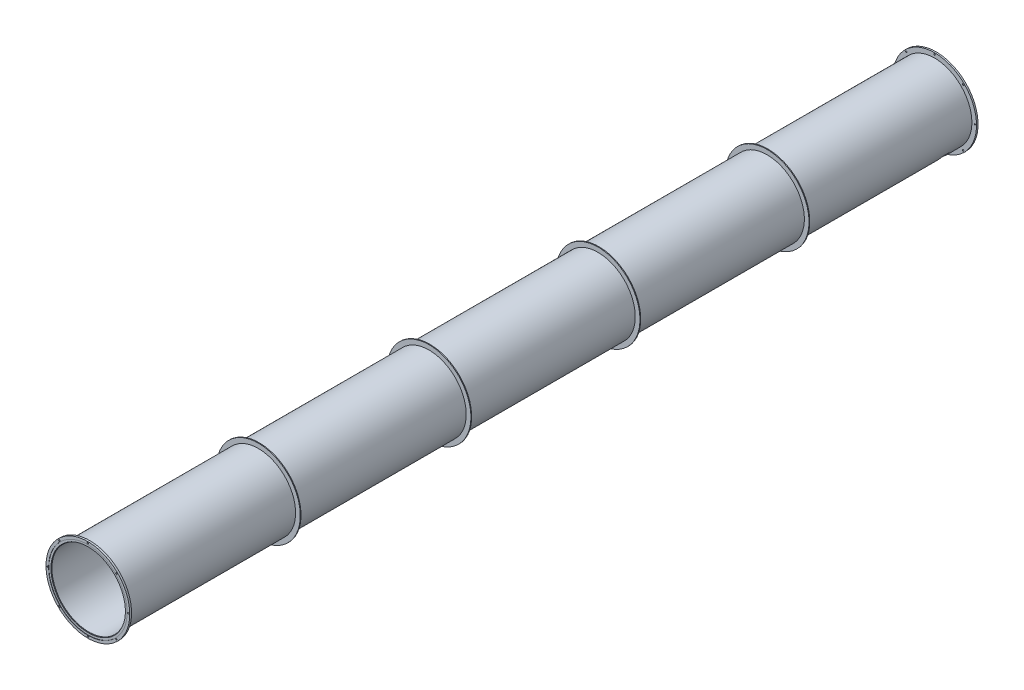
ISO-10303-21;
HEADER;
FILE_DESCRIPTION(('STEP AP214'),'2;1');
FILE_NAME('part.step','',(''),(''),'','','');
FILE_SCHEMA(('AUTOMOTIVE_DESIGN { 1 0 10303 214 1 1 1 1 }'));
ENDSEC;
DATA;
#1=APPLICATION_CONTEXT('core data for automotive mechanical design processes');
#2=APPLICATION_PROTOCOL_DEFINITION('international standard','automotive_design',2000,#1);
#3=PRODUCT_CONTEXT('',#1,'mechanical');
#4=PRODUCT('Part','Part','',(#3));
#5=PRODUCT_RELATED_PRODUCT_CATEGORY('part','',(#4));
#6=PRODUCT_DEFINITION_FORMATION('','',#4);
#7=PRODUCT_DEFINITION_CONTEXT('part definition',#1,'design');
#8=PRODUCT_DEFINITION('design','',#6,#7);
#9=PRODUCT_DEFINITION_SHAPE('','',#8);
#10=(LENGTH_UNIT() NAMED_UNIT(*) SI_UNIT(.MILLI.,.METRE.));
#11=(NAMED_UNIT(*) PLANE_ANGLE_UNIT() SI_UNIT($,.RADIAN.));
#12=(NAMED_UNIT(*) SI_UNIT($,.STERADIAN.) SOLID_ANGLE_UNIT());
#13=UNCERTAINTY_MEASURE_WITH_UNIT(LENGTH_MEASURE(1.E-05),#10,'distance_accuracy_value','');
#14=(GEOMETRIC_REPRESENTATION_CONTEXT(3) GLOBAL_UNCERTAINTY_ASSIGNED_CONTEXT((#13)) GLOBAL_UNIT_ASSIGNED_CONTEXT((#10,
#11,#12)) REPRESENTATION_CONTEXT('',''));
#15=CARTESIAN_POINT('',(0.,0.,0.));
#16=DIRECTION('',(0.,0.,1.));
#17=DIRECTION('',(1.,0.,0.));
#18=AXIS2_PLACEMENT_3D('',#15,#16,#17);
#19=CARTESIAN_POINT('',(685.799999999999,0.,-6940.55));
#20=DIRECTION('',(0.,0.,1.));
#21=DIRECTION('',(1.,0.,0.));
#22=AXIS2_PLACEMENT_3D('',#19,#20,#21);
#23=PLANE('',#22);
#24=CARTESIAN_POINT('',(-660.4,0.,-6940.55));
#25=DIRECTION('',(0.,0.,-1.));
#26=DIRECTION('',(-1.,0.,0.));
#27=AXIS2_PLACEMENT_3D('',#24,#25,#26);
#28=CIRCLE('',#27,11.1125);
#29=CARTESIAN_POINT('',(-671.5125,0.,-6940.55));
#30=VERTEX_POINT('',#29);
#31=EDGE_CURVE('E420',#30,#30,#28,.T.);
#32=ORIENTED_EDGE('',*,*,#31,.F.);
#33=EDGE_LOOP('',(#32));
#34=FACE_BOUND('',#33,.T.);
#35=CARTESIAN_POINT('',(0.,0.,-6940.55));
#36=DIRECTION('',(0.,0.,-1.));
#37=DIRECTION('',(-1.,0.,0.));
#38=AXIS2_PLACEMENT_3D('',#35,#36,#37);
#39=CIRCLE('',#38,641.349999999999);
#40=CARTESIAN_POINT('',(-641.349999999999,0.,-6940.55));
#41=VERTEX_POINT('',#40);
#42=EDGE_CURVE('E215',#41,#41,#39,.T.);
#43=ORIENTED_EDGE('',*,*,#42,.F.);
#44=EDGE_LOOP('',(#43));
#45=FACE_BOUND('',#44,.T.);
#46=CARTESIAN_POINT('',(0.,0.,-6940.55));
#47=DIRECTION('',(0.,0.,-1.));
#48=DIRECTION('',(-1.,0.,0.));
#49=AXIS2_PLACEMENT_3D('',#46,#47,#48);
#50=CIRCLE('',#49,685.799999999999);
#51=CARTESIAN_POINT('',(-685.799999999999,0.,-6940.55));
#52=VERTEX_POINT('',#51);
#53=EDGE_CURVE('E205',#52,#52,#50,.T.);
#54=ORIENTED_EDGE('',*,*,#53,.T.);
#55=EDGE_LOOP('',(#54));
#56=FACE_BOUND('',#55,.T.);
#57=CARTESIAN_POINT('',(-466.973318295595,-466.973318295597,-6940.55));
#58=DIRECTION('',(0.,0.,-1.));
#59=DIRECTION('',(-1.,0.,0.));
#60=AXIS2_PLACEMENT_3D('',#57,#58,#59);
#61=CIRCLE('',#60,11.1125);
#62=CARTESIAN_POINT('',(-478.085818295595,-466.973318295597,-6940.55));
#63=VERTEX_POINT('',#62);
#64=EDGE_CURVE('E368',#63,#63,#61,.T.);
#65=ORIENTED_EDGE('',*,*,#64,.F.);
#66=EDGE_LOOP('',(#65));
#67=FACE_BOUND('',#66,.T.);
#68=CARTESIAN_POINT('',(2.30577427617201E-12,-660.4,-6940.55));
#69=DIRECTION('',(0.,0.,-1.));
#70=DIRECTION('',(-1.,0.,0.));
#71=AXIS2_PLACEMENT_3D('',#68,#69,#70);
#72=CIRCLE('',#71,11.1125);
#73=CARTESIAN_POINT('',(-11.1124999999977,-660.4,-6940.55));
#74=VERTEX_POINT('',#73);
#75=EDGE_CURVE('E372',#74,#74,#72,.T.);
#76=ORIENTED_EDGE('',*,*,#75,.F.);
#77=EDGE_LOOP('',(#76));
#78=FACE_BOUND('',#77,.T.);
#79=CARTESIAN_POINT('',(466.973318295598,-466.973318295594,-6940.55));
#80=DIRECTION('',(0.,0.,-1.));
#81=DIRECTION('',(-1.,0.,0.));
#82=AXIS2_PLACEMENT_3D('',#79,#80,#81);
#83=CIRCLE('',#82,11.1125);
#84=CARTESIAN_POINT('',(455.860818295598,-466.973318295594,-6940.55));
#85=VERTEX_POINT('',#84);
#86=EDGE_CURVE('E376',#85,#85,#83,.T.);
#87=ORIENTED_EDGE('',*,*,#86,.F.);
#88=EDGE_LOOP('',(#87));
#89=FACE_BOUND('',#88,.T.);
#90=CARTESIAN_POINT('',(660.4,0.,-6940.55));
#91=DIRECTION('',(0.,0.,-1.));
#92=DIRECTION('',(-1.,0.,0.));
#93=AXIS2_PLACEMENT_3D('',#90,#91,#92);
#94=CIRCLE('',#93,11.1125);
#95=CARTESIAN_POINT('',(649.2875,0.,-6940.55));
#96=VERTEX_POINT('',#95);
#97=EDGE_CURVE('E380',#96,#96,#94,.T.);
#98=ORIENTED_EDGE('',*,*,#97,.F.);
#99=EDGE_LOOP('',(#98));
#100=FACE_BOUND('',#99,.T.);
#101=CARTESIAN_POINT('',(466.973318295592,466.9733182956,-6940.55));
#102=DIRECTION('',(0.,0.,-1.));
#103=DIRECTION('',(-1.,0.,0.));
#104=AXIS2_PLACEMENT_3D('',#101,#102,#103);
#105=CIRCLE('',#104,11.1125);
#106=CARTESIAN_POINT('',(455.860818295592,466.9733182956,-6940.55));
#107=VERTEX_POINT('',#106);
#108=EDGE_CURVE('E384',#107,#107,#105,.T.);
#109=ORIENTED_EDGE('',*,*,#108,.F.);
#110=EDGE_LOOP('',(#109));
#111=FACE_BOUND('',#110,.T.);
#112=CARTESIAN_POINT('',(-6.91732282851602E-12,660.4,-6940.55));
#113=DIRECTION('',(0.,0.,-1.));
#114=DIRECTION('',(-1.,0.,0.));
#115=AXIS2_PLACEMENT_3D('',#112,#113,#114);
#116=CIRCLE('',#115,11.1125);
#117=CARTESIAN_POINT('',(-11.1125000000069,660.4,-6940.55));
#118=VERTEX_POINT('',#117);
#119=EDGE_CURVE('E388',#118,#118,#116,.T.);
#120=ORIENTED_EDGE('',*,*,#119,.F.);
#121=EDGE_LOOP('',(#120));
#122=FACE_BOUND('',#121,.T.);
#123=CARTESIAN_POINT('',(-466.973318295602,466.97331829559,-6940.55));
#124=DIRECTION('',(0.,0.,-1.));
#125=DIRECTION('',(-1.,0.,0.));
#126=AXIS2_PLACEMENT_3D('',#123,#124,#125);
#127=CIRCLE('',#126,11.1125);
#128=CARTESIAN_POINT('',(-478.085818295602,466.97331829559,-6940.55));
#129=VERTEX_POINT('',#128);
#130=EDGE_CURVE('E78',#129,#129,#127,.T.);
#131=ORIENTED_EDGE('',*,*,#130,.F.);
#132=EDGE_LOOP('',(#131));
#133=FACE_BOUND('',#132,.T.);
#134=ADVANCED_FACE('F30',(#34,#45,#56,#67,#78,#89,#100,#111,#122,#133),#23,.F.);
#135=CARTESIAN_POINT('',(685.800000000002,0.,6951.6625));
#136=DIRECTION('',(0.,0.,-1.));
#137=DIRECTION('',(-1.,0.,0.));
#138=AXIS2_PLACEMENT_3D('',#135,#136,#137);
#139=PLANE('',#138);
#140=CARTESIAN_POINT('',(-466.973318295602,466.97331829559,6951.6625));
#141=DIRECTION('',(0.,0.,1.));
#142=DIRECTION('',(1.,0.,0.));
#143=AXIS2_PLACEMENT_3D('',#140,#141,#142);
#144=CIRCLE('',#143,11.1125);
#145=CARTESIAN_POINT('',(-455.860818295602,466.97331829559,6951.6625));
#146=VERTEX_POINT('',#145);
#147=EDGE_CURVE('E426',#146,#146,#144,.T.);
#148=ORIENTED_EDGE('',*,*,#147,.F.);
#149=EDGE_LOOP('',(#148));
#150=FACE_BOUND('',#149,.T.);
#151=CARTESIAN_POINT('',(-6.99819850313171E-12,660.4,6951.6625));
#152=DIRECTION('',(0.,0.,1.));
#153=DIRECTION('',(1.,0.,0.));
#154=AXIS2_PLACEMENT_3D('',#151,#152,#153);
#155=CIRCLE('',#154,11.1125);
#156=CARTESIAN_POINT('',(11.112499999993,660.4,6951.6625));
#157=VERTEX_POINT('',#156);
#158=EDGE_CURVE('E306',#157,#157,#155,.T.);
#159=ORIENTED_EDGE('',*,*,#158,.F.);
#160=EDGE_LOOP('',(#159));
#161=FACE_BOUND('',#160,.T.);
#162=CARTESIAN_POINT('',(-466.973318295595,-466.973318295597,6951.6625));
#163=DIRECTION('',(0.,0.,1.));
#164=DIRECTION('',(1.,0.,0.));
#165=AXIS2_PLACEMENT_3D('',#162,#163,#164);
#166=CIRCLE('',#165,11.1125);
#167=CARTESIAN_POINT('',(-455.860818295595,-466.973318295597,6951.6625));
#168=VERTEX_POINT('',#167);
#169=EDGE_CURVE('E322',#168,#168,#166,.T.);
#170=ORIENTED_EDGE('',*,*,#169,.F.);
#171=EDGE_LOOP('',(#170));
#172=FACE_BOUND('',#171,.T.);
#173=CARTESIAN_POINT('',(-660.4,0.,6951.6625));
#174=DIRECTION('',(0.,0.,1.));
#175=DIRECTION('',(1.,0.,0.));
#176=AXIS2_PLACEMENT_3D('',#173,#174,#175);
#177=CIRCLE('',#176,11.1125);
#178=CARTESIAN_POINT('',(-649.2875,0.,6951.6625));
#179=VERTEX_POINT('',#178);
#180=EDGE_CURVE('E328',#179,#179,#177,.T.);
#181=ORIENTED_EDGE('',*,*,#180,.F.);
#182=EDGE_LOOP('',(#181));
#183=FACE_BOUND('',#182,.T.);
#184=CARTESIAN_POINT('',(0.,0.,6951.6625));
#185=DIRECTION('',(0.,0.,-1.));
#186=DIRECTION('',(-1.,0.,0.));
#187=AXIS2_PLACEMENT_3D('',#184,#185,#186);
#188=CIRCLE('',#187,685.800000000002);
#189=CARTESIAN_POINT('',(-685.800000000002,0.,6951.6625));
#190=VERTEX_POINT('',#189);
#191=EDGE_CURVE('E272',#190,#190,#188,.T.);
#192=ORIENTED_EDGE('',*,*,#191,.F.);
#193=EDGE_LOOP('',(#192));
#194=FACE_BOUND('',#193,.T.);
#195=CARTESIAN_POINT('',(0.,0.,6951.6625));
#196=DIRECTION('',(0.,0.,-1.));
#197=DIRECTION('',(-1.,0.,0.));
#198=AXIS2_PLACEMENT_3D('',#195,#196,#197);
#199=CIRCLE('',#198,642.937500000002);
#200=CARTESIAN_POINT('',(-642.937500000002,0.,6951.6625));
#201=VERTEX_POINT('',#200);
#202=EDGE_CURVE('E275',#201,#201,#199,.T.);
#203=ORIENTED_EDGE('',*,*,#202,.T.);
#204=EDGE_LOOP('',(#203));
#205=FACE_BOUND('',#204,.T.);
#206=CARTESIAN_POINT('',(2.3866499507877E-12,-660.4,6951.6625));
#207=DIRECTION('',(0.,0.,1.));
#208=DIRECTION('',(1.,0.,0.));
#209=AXIS2_PLACEMENT_3D('',#206,#207,#208);
#210=CIRCLE('',#209,11.1125);
#211=CARTESIAN_POINT('',(11.1125000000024,-660.4,6951.6625));
#212=VERTEX_POINT('',#211);
#213=EDGE_CURVE('E287',#212,#212,#210,.T.);
#214=ORIENTED_EDGE('',*,*,#213,.F.);
#215=EDGE_LOOP('',(#214));
#216=FACE_BOUND('',#215,.T.);
#217=CARTESIAN_POINT('',(466.973318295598,-466.973318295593,6951.6625));
#218=DIRECTION('',(0.,0.,1.));
#219=DIRECTION('',(1.,0.,0.));
#220=AXIS2_PLACEMENT_3D('',#217,#218,#219);
#221=CIRCLE('',#220,11.1125);
#222=CARTESIAN_POINT('',(478.085818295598,-466.973318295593,6951.6625));
#223=VERTEX_POINT('',#222);
#224=EDGE_CURVE('E291',#223,#223,#221,.T.);
#225=ORIENTED_EDGE('',*,*,#224,.F.);
#226=EDGE_LOOP('',(#225));
#227=FACE_BOUND('',#226,.T.);
#228=CARTESIAN_POINT('',(660.4,0.,6951.6625));
#229=DIRECTION('',(0.,0.,1.));
#230=DIRECTION('',(1.,0.,0.));
#231=AXIS2_PLACEMENT_3D('',#228,#229,#230);
#232=CIRCLE('',#231,11.1125);
#233=CARTESIAN_POINT('',(671.5125,0.,6951.6625));
#234=VERTEX_POINT('',#233);
#235=EDGE_CURVE('E295',#234,#234,#232,.T.);
#236=ORIENTED_EDGE('',*,*,#235,.F.);
#237=EDGE_LOOP('',(#236));
#238=FACE_BOUND('',#237,.T.);
#239=CARTESIAN_POINT('',(466.973318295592,466.9733182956,6951.6625));
#240=DIRECTION('',(0.,0.,1.));
#241=DIRECTION('',(1.,0.,0.));
#242=AXIS2_PLACEMENT_3D('',#239,#240,#241);
#243=CIRCLE('',#242,11.1125);
#244=CARTESIAN_POINT('',(478.085818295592,466.9733182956,6951.6625));
#245=VERTEX_POINT('',#244);
#246=EDGE_CURVE('E298',#245,#245,#243,.T.);
#247=ORIENTED_EDGE('',*,*,#246,.F.);
#248=EDGE_LOOP('',(#247));
#249=FACE_BOUND('',#248,.T.);
#250=ADVANCED_FACE('F164',(#150,#161,#172,#183,#194,#205,#216,#227,#238,#249),#139,.F.);
#251=CARTESIAN_POINT('',(0.,0.,6937.375));
#252=DIRECTION('',(0.,0.,1.));
#253=DIRECTION('',(1.,0.,0.));
#254=AXIS2_PLACEMENT_3D('',#251,#252,#253);
#255=CONICAL_SURFACE('',#254,603.249999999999,0.785398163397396);
#256=CARTESIAN_POINT('',(0.,0.,6943.725));
#257=DIRECTION('',(0.,0.,-1.));
#258=DIRECTION('',(-1.,0.,0.));
#259=AXIS2_PLACEMENT_3D('',#256,#257,#258);
#260=CIRCLE('',#259,609.599999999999);
#261=CARTESIAN_POINT('',(-609.599999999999,0.,6943.725));
#262=VERTEX_POINT('',#261);
#263=EDGE_CURVE('E10',#262,#262,#260,.T.);
#264=ORIENTED_EDGE('',*,*,#263,.F.);
#265=EDGE_LOOP('',(#264));
#266=FACE_BOUND('',#265,.T.);
#267=CARTESIAN_POINT('',(0.,0.,6937.375));
#268=DIRECTION('',(0.,0.,-1.));
#269=DIRECTION('',(-1.,0.,0.));
#270=AXIS2_PLACEMENT_3D('',#267,#268,#269);
#271=CIRCLE('',#270,603.249999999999);
#272=CARTESIAN_POINT('',(-603.249999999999,0.,6937.375));
#273=VERTEX_POINT('',#272);
#274=EDGE_CURVE('E334',#273,#273,#271,.T.);
#275=ORIENTED_EDGE('',*,*,#274,.T.);
#276=EDGE_LOOP('',(#275));
#277=FACE_BOUND('',#276,.T.);
#278=ADVANCED_FACE('F32',(#266,#277),#255,.F.);
#279=CARTESIAN_POINT('',(0.,0.,-88.99));
#280=DIRECTION('',(0.,0.,-1.));
#281=DIRECTION('',(-1.,0.,0.));
#282=AXIS2_PLACEMENT_3D('',#279,#280,#281);
#283=CYLINDRICAL_SURFACE('',#282,609.599999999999);
#284=CARTESIAN_POINT('',(0.,0.,6946.9));
#285=DIRECTION('',(0.,0.,-1.));
#286=DIRECTION('',(-1.,0.,0.));
#287=AXIS2_PLACEMENT_3D('',#284,#285,#286);
#288=CIRCLE('',#287,609.599999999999);
#289=CARTESIAN_POINT('',(-609.599999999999,0.,6946.9));
#290=VERTEX_POINT('',#289);
#291=EDGE_CURVE('E42',#290,#290,#288,.T.);
#292=ORIENTED_EDGE('',*,*,#291,.F.);
#293=EDGE_LOOP('',(#292));
#294=FACE_BOUND('',#293,.T.);
#295=ORIENTED_EDGE('',*,*,#263,.T.);
#296=EDGE_LOOP('',(#295));
#297=FACE_BOUND('',#296,.T.);
#298=ADVANCED_FACE('F173',(#294,#297),#283,.F.);
#299=CARTESIAN_POINT('',(642.937500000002,0.,6946.9));
#300=DIRECTION('',(0.,0.,-1.));
#301=DIRECTION('',(-1.,0.,0.));
#302=AXIS2_PLACEMENT_3D('',#299,#300,#301);
#303=PLANE('',#302);
#304=CARTESIAN_POINT('',(0.,0.,6946.9));
#305=DIRECTION('',(0.,0.,-1.));
#306=DIRECTION('',(-1.,0.,0.));
#307=AXIS2_PLACEMENT_3D('',#304,#305,#306);
#308=CIRCLE('',#307,642.937500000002);
#309=CARTESIAN_POINT('',(-642.937500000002,0.,6946.9));
#310=VERTEX_POINT('',#309);
#311=EDGE_CURVE('E47',#310,#310,#308,.T.);
#312=ORIENTED_EDGE('',*,*,#311,.F.);
#313=EDGE_LOOP('',(#312));
#314=FACE_BOUND('',#313,.T.);
#315=ORIENTED_EDGE('',*,*,#291,.T.);
#316=EDGE_LOOP('',(#315));
#317=FACE_BOUND('',#316,.T.);
#318=ADVANCED_FACE('F170',(#314,#317),#303,.F.);
#319=CARTESIAN_POINT('',(0.,0.,-88.99));
#320=DIRECTION('',(0.,0.,-1.));
#321=DIRECTION('',(-1.,0.,0.));
#322=AXIS2_PLACEMENT_3D('',#319,#320,#321);
#323=CYLINDRICAL_SURFACE('',#322,642.937500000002);
#324=ORIENTED_EDGE('',*,*,#202,.F.);
#325=EDGE_LOOP('',(#324));
#326=FACE_BOUND('',#325,.T.);
#327=ORIENTED_EDGE('',*,*,#311,.T.);
#328=EDGE_LOOP('',(#327));
#329=FACE_BOUND('',#328,.T.);
#330=ADVANCED_FACE('F162',(#326,#329),#323,.F.);
#331=CARTESIAN_POINT('',(0.,0.,-88.99));
#332=DIRECTION('',(0.,0.,-1.));
#333=DIRECTION('',(-1.,0.,0.));
#334=AXIS2_PLACEMENT_3D('',#331,#332,#333);
#335=CYLINDRICAL_SURFACE('',#334,685.800000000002);
#336=CARTESIAN_POINT('',(0.,0.,6921.5));
#337=DIRECTION('',(0.,0.,-1.));
#338=DIRECTION('',(-1.,0.,0.));
#339=AXIS2_PLACEMENT_3D('',#336,#337,#338);
#340=CIRCLE('',#339,685.800000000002);
#341=CARTESIAN_POINT('',(-685.800000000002,0.,6921.5));
#342=VERTEX_POINT('',#341);
#343=EDGE_CURVE('E269',#342,#342,#340,.T.);
#344=ORIENTED_EDGE('',*,*,#343,.F.);
#345=EDGE_LOOP('',(#344));
#346=FACE_BOUND('',#345,.T.);
#347=ORIENTED_EDGE('',*,*,#191,.T.);
#348=EDGE_LOOP('',(#347));
#349=FACE_BOUND('',#348,.T.);
#350=ADVANCED_FACE('F158',(#346,#349),#335,.T.);
#351=CARTESIAN_POINT('',(609.599999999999,0.,6921.5));
#352=DIRECTION('',(0.,0.,1.));
#353=DIRECTION('',(1.,0.,0.));
#354=AXIS2_PLACEMENT_3D('',#351,#352,#353);
#355=PLANE('',#354);
#356=CARTESIAN_POINT('',(-466.973318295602,466.97331829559,6921.5));
#357=DIRECTION('',(0.,0.,1.));
#358=DIRECTION('',(1.,0.,0.));
#359=AXIS2_PLACEMENT_3D('',#356,#357,#358);
#360=CIRCLE('',#359,11.1124999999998);
#361=CARTESIAN_POINT('',(-455.860818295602,466.97331829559,6921.5));
#362=VERTEX_POINT('',#361);
#363=EDGE_CURVE('E429',#362,#362,#360,.T.);
#364=ORIENTED_EDGE('',*,*,#363,.T.);
#365=EDGE_LOOP('',(#364));
#366=FACE_BOUND('',#365,.T.);
#367=CARTESIAN_POINT('',(-6.99819850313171E-12,660.4,6921.5));
#368=DIRECTION('',(0.,0.,1.));
#369=DIRECTION('',(1.,0.,0.));
#370=AXIS2_PLACEMENT_3D('',#367,#368,#369);
#371=CIRCLE('',#370,11.1124999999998);
#372=CARTESIAN_POINT('',(11.1124999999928,660.4,6921.5));
#373=VERTEX_POINT('',#372);
#374=EDGE_CURVE('E301',#373,#373,#371,.T.);
#375=ORIENTED_EDGE('',*,*,#374,.T.);
#376=EDGE_LOOP('',(#375));
#377=FACE_BOUND('',#376,.T.);
#378=CARTESIAN_POINT('',(466.973318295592,466.9733182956,6921.5));
#379=DIRECTION('',(0.,0.,1.));
#380=DIRECTION('',(1.,0.,0.));
#381=AXIS2_PLACEMENT_3D('',#378,#379,#380);
#382=CIRCLE('',#381,11.1124999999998);
#383=CARTESIAN_POINT('',(478.085818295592,466.9733182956,6921.5));
#384=VERTEX_POINT('',#383);
#385=EDGE_CURVE('E300',#384,#384,#382,.T.);
#386=ORIENTED_EDGE('',*,*,#385,.T.);
#387=EDGE_LOOP('',(#386));
#388=FACE_BOUND('',#387,.T.);
#389=CARTESIAN_POINT('',(660.4,0.,6921.5));
#390=DIRECTION('',(0.,0.,1.));
#391=DIRECTION('',(1.,0.,0.));
#392=AXIS2_PLACEMENT_3D('',#389,#390,#391);
#393=CIRCLE('',#392,11.1124999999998);
#394=CARTESIAN_POINT('',(671.5125,0.,6921.5));
#395=VERTEX_POINT('',#394);
#396=EDGE_CURVE('E311',#395,#395,#393,.T.);
#397=ORIENTED_EDGE('',*,*,#396,.T.);
#398=EDGE_LOOP('',(#397));
#399=FACE_BOUND('',#398,.T.);
#400=CARTESIAN_POINT('',(466.973318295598,-466.973318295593,6921.5));
#401=DIRECTION('',(0.,0.,1.));
#402=DIRECTION('',(1.,0.,0.));
#403=AXIS2_PLACEMENT_3D('',#400,#401,#402);
#404=CIRCLE('',#403,11.1124999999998);
#405=CARTESIAN_POINT('',(478.085818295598,-466.973318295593,6921.5));
#406=VERTEX_POINT('',#405);
#407=EDGE_CURVE('E315',#406,#406,#404,.T.);
#408=ORIENTED_EDGE('',*,*,#407,.T.);
#409=EDGE_LOOP('',(#408));
#410=FACE_BOUND('',#409,.T.);
#411=CARTESIAN_POINT('',(2.3866499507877E-12,-660.4,6921.5));
#412=DIRECTION('',(0.,0.,1.));
#413=DIRECTION('',(1.,0.,0.));
#414=AXIS2_PLACEMENT_3D('',#411,#412,#413);
#415=CIRCLE('',#414,11.1124999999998);
#416=CARTESIAN_POINT('',(11.1125000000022,-660.4,6921.5));
#417=VERTEX_POINT('',#416);
#418=EDGE_CURVE('E319',#417,#417,#415,.T.);
#419=ORIENTED_EDGE('',*,*,#418,.T.);
#420=EDGE_LOOP('',(#419));
#421=FACE_BOUND('',#420,.T.);
#422=CARTESIAN_POINT('',(-466.973318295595,-466.973318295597,6921.5));
#423=DIRECTION('',(0.,0.,1.));
#424=DIRECTION('',(1.,0.,0.));
#425=AXIS2_PLACEMENT_3D('',#422,#423,#424);
#426=CIRCLE('',#425,11.1125);
#427=CARTESIAN_POINT('',(-455.860818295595,-466.973318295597,6921.5));
#428=VERTEX_POINT('',#427);
#429=EDGE_CURVE('E325',#428,#428,#426,.T.);
#430=ORIENTED_EDGE('',*,*,#429,.T.);
#431=EDGE_LOOP('',(#430));
#432=FACE_BOUND('',#431,.T.);
#433=CARTESIAN_POINT('',(-660.4,0.,6921.5));
#434=DIRECTION('',(0.,0.,1.));
#435=DIRECTION('',(1.,0.,0.));
#436=AXIS2_PLACEMENT_3D('',#433,#434,#435);
#437=CIRCLE('',#436,11.1124999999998);
#438=CARTESIAN_POINT('',(-649.2875,0.,6921.5));
#439=VERTEX_POINT('',#438);
#440=EDGE_CURVE('E331',#439,#439,#437,.T.);
#441=ORIENTED_EDGE('',*,*,#440,.T.);
#442=EDGE_LOOP('',(#441));
#443=FACE_BOUND('',#442,.T.);
#444=CARTESIAN_POINT('',(0.,0.,6921.5));
#445=DIRECTION('',(0.,0.,-1.));
#446=DIRECTION('',(-1.,0.,0.));
#447=AXIS2_PLACEMENT_3D('',#444,#445,#446);
#448=CIRCLE('',#447,609.599999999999);
#449=CARTESIAN_POINT('',(-609.599999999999,0.,6921.5));
#450=VERTEX_POINT('',#449);
#451=EDGE_CURVE('E266',#450,#450,#448,.T.);
#452=ORIENTED_EDGE('',*,*,#451,.F.);
#453=EDGE_LOOP('',(#452));
#454=FACE_BOUND('',#453,.T.);
#455=ORIENTED_EDGE('',*,*,#343,.T.);
#456=EDGE_LOOP('',(#455));
#457=FACE_BOUND('',#456,.T.);
#458=ADVANCED_FACE('F154',(#366,#377,#388,#399,#410,#421,#432,#443,#454,#457),#355,.F.);
#459=CARTESIAN_POINT('',(0.,0.,-88.99));
#460=DIRECTION('',(0.,0.,-1.));
#461=DIRECTION('',(-1.,0.,0.));
#462=AXIS2_PLACEMENT_3D('',#459,#460,#461);
#463=CYLINDRICAL_SURFACE('',#462,609.599999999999);
#464=CARTESIAN_POINT('',(0.,0.,4159.25));
#465=DIRECTION('',(0.,0.,-1.));
#466=DIRECTION('',(-1.,0.,0.));
#467=AXIS2_PLACEMENT_3D('',#464,#465,#466);
#468=CIRCLE('',#467,609.599999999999);
#469=CARTESIAN_POINT('',(-609.599999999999,0.,4159.25));
#470=VERTEX_POINT('',#469);
#471=EDGE_CURVE('E263',#470,#470,#468,.T.);
#472=ORIENTED_EDGE('',*,*,#471,.F.);
#473=EDGE_LOOP('',(#472));
#474=FACE_BOUND('',#473,.T.);
#475=ORIENTED_EDGE('',*,*,#451,.T.);
#476=EDGE_LOOP('',(#475));
#477=FACE_BOUND('',#476,.T.);
#478=ADVANCED_FACE('F150',(#474,#477),#463,.T.);
#479=CARTESIAN_POINT('',(685.799999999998,0.,4159.25));
#480=DIRECTION('',(0.,0.,-1.));
#481=DIRECTION('',(-1.,0.,0.));
#482=AXIS2_PLACEMENT_3D('',#479,#480,#481);
#483=PLANE('',#482);
#484=CARTESIAN_POINT('',(0.,0.,4159.25));
#485=DIRECTION('',(0.,0.,-1.));
#486=DIRECTION('',(-1.,0.,0.));
#487=AXIS2_PLACEMENT_3D('',#484,#485,#486);
#488=CIRCLE('',#487,685.799999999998);
#489=CARTESIAN_POINT('',(-685.799999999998,0.,4159.25));
#490=VERTEX_POINT('',#489);
#491=EDGE_CURVE('E260',#490,#490,#488,.T.);
#492=ORIENTED_EDGE('',*,*,#491,.F.);
#493=EDGE_LOOP('',(#492));
#494=FACE_BOUND('',#493,.T.);
#495=ORIENTED_EDGE('',*,*,#471,.T.);
#496=EDGE_LOOP('',(#495));
#497=FACE_BOUND('',#496,.T.);
#498=ADVANCED_FACE('F146',(#494,#497),#483,.F.);
#499=CARTESIAN_POINT('',(0.,0.,-88.99));
#500=DIRECTION('',(0.,0.,-1.));
#501=DIRECTION('',(-1.,0.,0.));
#502=AXIS2_PLACEMENT_3D('',#499,#500,#501);
#503=CYLINDRICAL_SURFACE('',#502,685.799999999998);
#504=CARTESIAN_POINT('',(0.,0.,4146.55));
#505=DIRECTION('',(0.,0.,-1.));
#506=DIRECTION('',(-1.,0.,0.));
#507=AXIS2_PLACEMENT_3D('',#504,#505,#506);
#508=CIRCLE('',#507,685.799999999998);
#509=CARTESIAN_POINT('',(-685.799999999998,0.,4146.55));
#510=VERTEX_POINT('',#509);
#511=EDGE_CURVE('E257',#510,#510,#508,.T.);
#512=ORIENTED_EDGE('',*,*,#511,.F.);
#513=EDGE_LOOP('',(#512));
#514=FACE_BOUND('',#513,.T.);
#515=ORIENTED_EDGE('',*,*,#491,.T.);
#516=EDGE_LOOP('',(#515));
#517=FACE_BOUND('',#516,.T.);
#518=ADVANCED_FACE('F142',(#514,#517),#503,.T.);
#519=CARTESIAN_POINT('',(609.599999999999,0.,4146.55));
#520=DIRECTION('',(0.,0.,1.));
#521=DIRECTION('',(1.,0.,0.));
#522=AXIS2_PLACEMENT_3D('',#519,#520,#521);
#523=PLANE('',#522);
#524=CARTESIAN_POINT('',(0.,0.,4146.55));
#525=DIRECTION('',(0.,0.,-1.));
#526=DIRECTION('',(-1.,0.,0.));
#527=AXIS2_PLACEMENT_3D('',#524,#525,#526);
#528=CIRCLE('',#527,609.599999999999);
#529=CARTESIAN_POINT('',(-609.599999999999,0.,4146.55));
#530=VERTEX_POINT('',#529);
#531=EDGE_CURVE('E254',#530,#530,#528,.T.);
#532=ORIENTED_EDGE('',*,*,#531,.F.);
#533=EDGE_LOOP('',(#532));
#534=FACE_BOUND('',#533,.T.);
#535=ORIENTED_EDGE('',*,*,#511,.T.);
#536=EDGE_LOOP('',(#535));
#537=FACE_BOUND('',#536,.T.);
#538=ADVANCED_FACE('F138',(#534,#537),#523,.F.);
#539=CARTESIAN_POINT('',(0.,0.,-88.99));
#540=DIRECTION('',(0.,0.,-1.));
#541=DIRECTION('',(-1.,0.,0.));
#542=AXIS2_PLACEMENT_3D('',#539,#540,#541);
#543=CYLINDRICAL_SURFACE('',#542,609.599999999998);
#544=CARTESIAN_POINT('',(0.,0.,1365.25));
#545=DIRECTION('',(0.,0.,-1.));
#546=DIRECTION('',(-1.,0.,0.));
#547=AXIS2_PLACEMENT_3D('',#544,#545,#546);
#548=CIRCLE('',#547,609.599999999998);
#549=CARTESIAN_POINT('',(-609.599999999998,0.,1365.25));
#550=VERTEX_POINT('',#549);
#551=EDGE_CURVE('E251',#550,#550,#548,.T.);
#552=ORIENTED_EDGE('',*,*,#551,.F.);
#553=EDGE_LOOP('',(#552));
#554=FACE_BOUND('',#553,.T.);
#555=ORIENTED_EDGE('',*,*,#531,.T.);
#556=EDGE_LOOP('',(#555));
#557=FACE_BOUND('',#556,.T.);
#558=ADVANCED_FACE('F134',(#554,#557),#543,.T.);
#559=CARTESIAN_POINT('',(685.799999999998,0.,1365.25));
#560=DIRECTION('',(0.,0.,-1.));
#561=DIRECTION('',(-1.,0.,0.));
#562=AXIS2_PLACEMENT_3D('',#559,#560,#561);
#563=PLANE('',#562);
#564=CARTESIAN_POINT('',(0.,0.,1365.25));
#565=DIRECTION('',(0.,0.,-1.));
#566=DIRECTION('',(-1.,0.,0.));
#567=AXIS2_PLACEMENT_3D('',#564,#565,#566);
#568=CIRCLE('',#567,685.799999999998);
#569=CARTESIAN_POINT('',(-685.799999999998,0.,1365.25));
#570=VERTEX_POINT('',#569);
#571=EDGE_CURVE('E248',#570,#570,#568,.T.);
#572=ORIENTED_EDGE('',*,*,#571,.F.);
#573=EDGE_LOOP('',(#572));
#574=FACE_BOUND('',#573,.T.);
#575=ORIENTED_EDGE('',*,*,#551,.T.);
#576=EDGE_LOOP('',(#575));
#577=FACE_BOUND('',#576,.T.);
#578=ADVANCED_FACE('F130',(#574,#577),#563,.F.);
#579=CARTESIAN_POINT('',(0.,0.,-88.99));
#580=DIRECTION('',(0.,0.,-1.));
#581=DIRECTION('',(-1.,0.,0.));
#582=AXIS2_PLACEMENT_3D('',#579,#580,#581);
#583=CYLINDRICAL_SURFACE('',#582,685.799999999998);
#584=CARTESIAN_POINT('',(0.,0.,1352.55));
#585=DIRECTION('',(0.,0.,-1.));
#586=DIRECTION('',(-1.,0.,0.));
#587=AXIS2_PLACEMENT_3D('',#584,#585,#586);
#588=CIRCLE('',#587,685.799999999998);
#589=CARTESIAN_POINT('',(-685.799999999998,0.,1352.55));
#590=VERTEX_POINT('',#589);
#591=EDGE_CURVE('E245',#590,#590,#588,.T.);
#592=ORIENTED_EDGE('',*,*,#591,.F.);
#593=EDGE_LOOP('',(#592));
#594=FACE_BOUND('',#593,.T.);
#595=ORIENTED_EDGE('',*,*,#571,.T.);
#596=EDGE_LOOP('',(#595));
#597=FACE_BOUND('',#596,.T.);
#598=ADVANCED_FACE('F126',(#594,#597),#583,.T.);
#599=CARTESIAN_POINT('',(609.599999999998,0.,1352.55));
#600=DIRECTION('',(0.,0.,1.));
#601=DIRECTION('',(1.,0.,0.));
#602=AXIS2_PLACEMENT_3D('',#599,#600,#601);
#603=PLANE('',#602);
#604=CARTESIAN_POINT('',(0.,0.,1352.55));
#605=DIRECTION('',(0.,0.,-1.));
#606=DIRECTION('',(-1.,0.,0.));
#607=AXIS2_PLACEMENT_3D('',#604,#605,#606);
#608=CIRCLE('',#607,609.599999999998);
#609=CARTESIAN_POINT('',(-609.599999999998,0.,1352.55));
#610=VERTEX_POINT('',#609);
#611=EDGE_CURVE('E242',#610,#610,#608,.T.);
#612=ORIENTED_EDGE('',*,*,#611,.F.);
#613=EDGE_LOOP('',(#612));
#614=FACE_BOUND('',#613,.T.);
#615=ORIENTED_EDGE('',*,*,#591,.T.);
#616=EDGE_LOOP('',(#615));
#617=FACE_BOUND('',#616,.T.);
#618=ADVANCED_FACE('F122',(#614,#617),#603,.F.);
#619=CARTESIAN_POINT('',(0.,0.,-88.99));
#620=DIRECTION('',(0.,0.,-1.));
#621=DIRECTION('',(-1.,0.,0.));
#622=AXIS2_PLACEMENT_3D('',#619,#620,#621);
#623=CYLINDRICAL_SURFACE('',#622,609.599999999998);
#624=CARTESIAN_POINT('',(0.,0.,-1403.35));
#625=DIRECTION('',(0.,0.,-1.));
#626=DIRECTION('',(-1.,0.,0.));
#627=AXIS2_PLACEMENT_3D('',#624,#625,#626);
#628=CIRCLE('',#627,609.599999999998);
#629=CARTESIAN_POINT('',(-609.599999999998,0.,-1403.35));
#630=VERTEX_POINT('',#629);
#631=EDGE_CURVE('E239',#630,#630,#628,.T.);
#632=ORIENTED_EDGE('',*,*,#631,.F.);
#633=EDGE_LOOP('',(#632));
#634=FACE_BOUND('',#633,.T.);
#635=ORIENTED_EDGE('',*,*,#611,.T.);
#636=EDGE_LOOP('',(#635));
#637=FACE_BOUND('',#636,.T.);
#638=ADVANCED_FACE('F118',(#634,#637),#623,.T.);
#639=CARTESIAN_POINT('',(685.799999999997,0.,-1403.35));
#640=DIRECTION('',(0.,0.,-1.));
#641=DIRECTION('',(-1.,0.,0.));
#642=AXIS2_PLACEMENT_3D('',#639,#640,#641);
#643=PLANE('',#642);
#644=CARTESIAN_POINT('',(0.,0.,-1403.35));
#645=DIRECTION('',(0.,0.,-1.));
#646=DIRECTION('',(-1.,0.,0.));
#647=AXIS2_PLACEMENT_3D('',#644,#645,#646);
#648=CIRCLE('',#647,685.799999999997);
#649=CARTESIAN_POINT('',(-685.799999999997,0.,-1403.35));
#650=VERTEX_POINT('',#649);
#651=EDGE_CURVE('E236',#650,#650,#648,.T.);
#652=ORIENTED_EDGE('',*,*,#651,.F.);
#653=EDGE_LOOP('',(#652));
#654=FACE_BOUND('',#653,.T.);
#655=ORIENTED_EDGE('',*,*,#631,.T.);
#656=EDGE_LOOP('',(#655));
#657=FACE_BOUND('',#656,.T.);
#658=ADVANCED_FACE('F114',(#654,#657),#643,.F.);
#659=CARTESIAN_POINT('',(0.,0.,-88.99));
#660=DIRECTION('',(0.,0.,-1.));
#661=DIRECTION('',(-1.,0.,0.));
#662=AXIS2_PLACEMENT_3D('',#659,#660,#661);
#663=CYLINDRICAL_SURFACE('',#662,685.799999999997);
#664=CARTESIAN_POINT('',(0.,0.,-1416.05));
#665=DIRECTION('',(0.,0.,-1.));
#666=DIRECTION('',(-1.,0.,0.));
#667=AXIS2_PLACEMENT_3D('',#664,#665,#666);
#668=CIRCLE('',#667,685.799999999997);
#669=CARTESIAN_POINT('',(-685.799999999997,0.,-1416.05));
#670=VERTEX_POINT('',#669);
#671=EDGE_CURVE('E233',#670,#670,#668,.T.);
#672=ORIENTED_EDGE('',*,*,#671,.F.);
#673=EDGE_LOOP('',(#672));
#674=FACE_BOUND('',#673,.T.);
#675=ORIENTED_EDGE('',*,*,#651,.T.);
#676=EDGE_LOOP('',(#675));
#677=FACE_BOUND('',#676,.T.);
#678=ADVANCED_FACE('F110',(#674,#677),#663,.T.);
#679=CARTESIAN_POINT('',(609.599999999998,0.,-1416.05));
#680=DIRECTION('',(0.,0.,1.));
#681=DIRECTION('',(1.,0.,0.));
#682=AXIS2_PLACEMENT_3D('',#679,#680,#681);
#683=PLANE('',#682);
#684=CARTESIAN_POINT('',(0.,0.,-1416.05));
#685=DIRECTION('',(0.,0.,-1.));
#686=DIRECTION('',(-1.,0.,0.));
#687=AXIS2_PLACEMENT_3D('',#684,#685,#686);
#688=CIRCLE('',#687,609.599999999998);
#689=CARTESIAN_POINT('',(-609.599999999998,0.,-1416.05));
#690=VERTEX_POINT('',#689);
#691=EDGE_CURVE('E230',#690,#690,#688,.T.);
#692=ORIENTED_EDGE('',*,*,#691,.F.);
#693=EDGE_LOOP('',(#692));
#694=FACE_BOUND('',#693,.T.);
#695=ORIENTED_EDGE('',*,*,#671,.T.);
#696=EDGE_LOOP('',(#695));
#697=FACE_BOUND('',#696,.T.);
#698=ADVANCED_FACE('F106',(#694,#697),#683,.F.);
#699=CARTESIAN_POINT('',(0.,0.,-88.99));
#700=DIRECTION('',(0.,0.,-1.));
#701=DIRECTION('',(-1.,0.,0.));
#702=AXIS2_PLACEMENT_3D('',#699,#700,#701);
#703=CYLINDRICAL_SURFACE('',#702,609.599999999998);
#704=CARTESIAN_POINT('',(0.,0.,-4171.95));
#705=DIRECTION('',(0.,0.,-1.));
#706=DIRECTION('',(-1.,0.,0.));
#707=AXIS2_PLACEMENT_3D('',#704,#705,#706);
#708=CIRCLE('',#707,609.599999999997);
#709=CARTESIAN_POINT('',(-609.599999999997,0.,-4171.95));
#710=VERTEX_POINT('',#709);
#711=EDGE_CURVE('E227',#710,#710,#708,.T.);
#712=ORIENTED_EDGE('',*,*,#711,.F.);
#713=EDGE_LOOP('',(#712));
#714=FACE_BOUND('',#713,.T.);
#715=ORIENTED_EDGE('',*,*,#691,.T.);
#716=EDGE_LOOP('',(#715));
#717=FACE_BOUND('',#716,.T.);
#718=ADVANCED_FACE('F102',(#714,#717),#703,.T.);
#719=CARTESIAN_POINT('',(685.799999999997,0.,-4171.95));
#720=DIRECTION('',(0.,0.,-1.));
#721=DIRECTION('',(-1.,0.,0.));
#722=AXIS2_PLACEMENT_3D('',#719,#720,#721);
#723=PLANE('',#722);
#724=CARTESIAN_POINT('',(0.,0.,-4171.95));
#725=DIRECTION('',(0.,0.,-1.));
#726=DIRECTION('',(-1.,0.,0.));
#727=AXIS2_PLACEMENT_3D('',#724,#725,#726);
#728=CIRCLE('',#727,685.799999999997);
#729=CARTESIAN_POINT('',(-685.799999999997,0.,-4171.95));
#730=VERTEX_POINT('',#729);
#731=EDGE_CURVE('E224',#730,#730,#728,.T.);
#732=ORIENTED_EDGE('',*,*,#731,.F.);
#733=EDGE_LOOP('',(#732));
#734=FACE_BOUND('',#733,.T.);
#735=ORIENTED_EDGE('',*,*,#711,.T.);
#736=EDGE_LOOP('',(#735));
#737=FACE_BOUND('',#736,.T.);
#738=ADVANCED_FACE('F98',(#734,#737),#723,.F.);
#739=CARTESIAN_POINT('',(0.,0.,-88.99));
#740=DIRECTION('',(0.,0.,-1.));
#741=DIRECTION('',(-1.,0.,0.));
#742=AXIS2_PLACEMENT_3D('',#739,#740,#741);
#743=CYLINDRICAL_SURFACE('',#742,685.799999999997);
#744=CARTESIAN_POINT('',(0.,0.,-4184.65));
#745=DIRECTION('',(0.,0.,-1.));
#746=DIRECTION('',(-1.,0.,0.));
#747=AXIS2_PLACEMENT_3D('',#744,#745,#746);
#748=CIRCLE('',#747,685.799999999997);
#749=CARTESIAN_POINT('',(-685.799999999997,0.,-4184.65));
#750=VERTEX_POINT('',#749);
#751=EDGE_CURVE('E221',#750,#750,#748,.T.);
#752=ORIENTED_EDGE('',*,*,#751,.F.);
#753=EDGE_LOOP('',(#752));
#754=FACE_BOUND('',#753,.T.);
#755=ORIENTED_EDGE('',*,*,#731,.T.);
#756=EDGE_LOOP('',(#755));
#757=FACE_BOUND('',#756,.T.);
#758=ADVANCED_FACE('F94',(#754,#757),#743,.T.);
#759=CARTESIAN_POINT('',(609.599999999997,0.,-4184.65));
#760=DIRECTION('',(0.,0.,1.));
#761=DIRECTION('',(1.,0.,0.));
#762=AXIS2_PLACEMENT_3D('',#759,#760,#761);
#763=PLANE('',#762);
#764=CARTESIAN_POINT('',(0.,0.,-4184.65));
#765=DIRECTION('',(0.,0.,-1.));
#766=DIRECTION('',(-1.,0.,0.));
#767=AXIS2_PLACEMENT_3D('',#764,#765,#766);
#768=CIRCLE('',#767,609.599999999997);
#769=CARTESIAN_POINT('',(-609.599999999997,0.,-4184.65));
#770=VERTEX_POINT('',#769);
#771=EDGE_CURVE('E213',#770,#770,#768,.T.);
#772=ORIENTED_EDGE('',*,*,#771,.F.);
#773=EDGE_LOOP('',(#772));
#774=FACE_BOUND('',#773,.T.);
#775=ORIENTED_EDGE('',*,*,#751,.T.);
#776=EDGE_LOOP('',(#775));
#777=FACE_BOUND('',#776,.T.);
#778=ADVANCED_FACE('F88',(#774,#777),#763,.F.);
#779=CARTESIAN_POINT('',(0.,0.,-88.99));
#780=DIRECTION('',(0.,0.,-1.));
#781=DIRECTION('',(-1.,0.,0.));
#782=AXIS2_PLACEMENT_3D('',#779,#780,#781);
#783=CYLINDRICAL_SURFACE('',#782,609.599999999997);
#784=CARTESIAN_POINT('',(353.181244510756,-496.865342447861,-6610.35));
#785=CARTESIAN_POINT('',(353.181241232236,-496.865343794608,-6608.93355352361));
#786=CARTESIAN_POINT('',(353.205733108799,-496.847937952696,-6607.51718672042));
#787=CARTESIAN_POINT('',(353.303624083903,-496.778333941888,-6604.68701160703));
#788=CARTESIAN_POINT('',(353.377021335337,-496.726137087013,-6603.27320320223));
#789=CARTESIAN_POINT('',(353.572545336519,-496.586980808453,-6600.45039360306));
#790=CARTESIAN_POINT('',(353.694682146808,-496.500014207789,-6599.0413934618));
#791=CARTESIAN_POINT('',(353.987355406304,-496.291390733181,-6596.2309775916));
#792=CARTESIAN_POINT('',(354.157892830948,-496.169733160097,-6594.8295620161));
#793=CARTESIAN_POINT('',(354.5470588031,-495.891722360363,-6592.03575379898));
#794=CARTESIAN_POINT('',(354.765725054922,-495.73534193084,-6590.64336911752));
#795=CARTESIAN_POINT('',(355.250504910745,-495.388057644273,-6587.87109311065));
#796=CARTESIAN_POINT('',(355.516622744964,-495.197150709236,-6586.49120291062));
#797=CARTESIAN_POINT('',(356.095542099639,-494.781014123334,-6583.74668233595));
#798=CARTESIAN_POINT('',(356.408337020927,-494.555789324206,-6582.38204983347));
#799=CARTESIAN_POINT('',(357.079843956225,-494.071165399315,-6579.6701233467));
#800=CARTESIAN_POINT('',(357.438560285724,-493.811763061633,-6578.32283100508));
#801=CARTESIAN_POINT('',(358.200597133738,-493.25927610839,-6575.64931284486));
#802=CARTESIAN_POINT('',(358.603876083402,-492.96622287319,-6574.32306869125));
#803=CARTESIAN_POINT('',(359.454308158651,-492.34646051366,-6571.69255313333));
#804=CARTESIAN_POINT('',(359.901465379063,-492.019748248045,-6570.3882837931));
#805=CARTESIAN_POINT('',(360.838445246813,-491.332996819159,-6567.80420386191));
#806=CARTESIAN_POINT('',(361.328264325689,-490.972960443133,-6566.52439123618));
#807=CARTESIAN_POINT('',(362.349417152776,-490.219810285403,-6563.99118990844));
#808=CARTESIAN_POINT('',(362.88075475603,-489.826693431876,-6562.73780367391));
#809=CARTESIAN_POINT('',(363.983465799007,-489.007840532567,-6560.25999276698));
#810=CARTESIAN_POINT('',(364.554830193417,-488.582111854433,-6559.03556163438));
#811=CARTESIAN_POINT('',(365.736355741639,-487.698290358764,-6556.61734065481));
#812=CARTESIAN_POINT('',(366.346520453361,-487.240194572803,-6555.42355363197));
#813=CARTESIAN_POINT('',(367.604092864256,-486.292104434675,-6553.0688354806));
#814=CARTESIAN_POINT('',(368.251497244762,-485.802112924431,-6551.90790143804));
#815=CARTESIAN_POINT('',(369.582057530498,-484.790636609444,-6549.62071513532));
#816=CARTESIAN_POINT('',(370.265216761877,-484.269148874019,-6548.49446611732));
#817=CARTESIAN_POINT('',(372.378208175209,-482.648732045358,-6545.15128358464));
#818=CARTESIAN_POINT('',(373.860742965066,-481.501974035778,-6542.99013969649));
#819=CARTESIAN_POINT('',(376.950885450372,-479.086667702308,-6538.83206387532));
#820=CARTESIAN_POINT('',(378.558493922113,-477.818118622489,-6536.83513296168));
#821=CARTESIAN_POINT('',(381.884491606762,-475.164098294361,-6533.01871300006));
#822=CARTESIAN_POINT('',(383.602887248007,-473.778620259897,-6531.19923426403));
#823=CARTESIAN_POINT('',(387.135046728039,-470.896814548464,-6527.75060993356));
#824=CARTESIAN_POINT('',(388.94881071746,-469.400486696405,-6526.12146463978));
#825=CARTESIAN_POINT('',(392.667048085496,-466.294596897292,-6523.05583560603));
#826=CARTESIAN_POINT('',(394.571999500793,-464.684410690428,-6521.62056364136));
#827=CARTESIAN_POINT('',(398.445997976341,-461.366935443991,-6518.96473936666));
#828=CARTESIAN_POINT('',(400.415045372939,-459.659645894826,-6517.7441881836));
#829=CARTESIAN_POINT('',(404.400411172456,-456.157323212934,-6515.52696637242));
#830=CARTESIAN_POINT('',(406.416727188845,-454.362294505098,-6514.5302844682));
#831=CARTESIAN_POINT('',(410.479906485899,-450.694902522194,-6512.76832584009));
#832=CARTESIAN_POINT('',(412.526769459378,-448.822540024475,-6512.00304679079));
#833=CARTESIAN_POINT('',(416.615370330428,-445.029770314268,-6510.71579851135));
#834=CARTESIAN_POINT('',(418.656981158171,-443.109966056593,-6510.19164875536));
#835=CARTESIAN_POINT('',(422.737824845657,-439.218442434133,-6509.38038179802));
#836=CARTESIAN_POINT('',(424.777057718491,-437.246723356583,-6509.0932632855));
#837=CARTESIAN_POINT('',(428.837539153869,-433.265057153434,-6508.75831401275));
#838=CARTESIAN_POINT('',(430.858788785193,-431.25511232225,-6508.71046893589));
#839=CARTESIAN_POINT('',(434.868617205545,-427.21136839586,-6508.85440489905));
#840=CARTESIAN_POINT('',(436.857196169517,-425.177569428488,-6509.04618465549));
#841=CARTESIAN_POINT('',(440.768220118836,-421.121591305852,-6509.66477195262));
#842=CARTESIAN_POINT('',(442.691125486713,-419.099497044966,-6510.08922894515));
#843=CARTESIAN_POINT('',(446.478659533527,-415.062197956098,-6511.16831064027));
#844=CARTESIAN_POINT('',(448.343288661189,-413.046993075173,-6511.8229335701));
#845=CARTESIAN_POINT('',(452.002808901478,-409.039100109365,-6513.35743606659));
#846=CARTESIAN_POINT('',(453.79769858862,-407.046412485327,-6514.23732023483));
#847=CARTESIAN_POINT('',(457.307323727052,-403.099425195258,-6516.21583611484));
#848=CARTESIAN_POINT('',(459.022058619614,-401.145125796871,-6517.31446935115));
#849=CARTESIAN_POINT('',(462.36974516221,-397.281942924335,-6519.72803112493));
#850=CARTESIAN_POINT('',(464.002287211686,-395.373307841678,-6521.04392526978));
#851=CARTESIAN_POINT('',(467.168861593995,-391.626648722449,-6523.87901802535));
#852=CARTESIAN_POINT('',(468.702893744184,-389.788624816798,-6525.39821701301));
#853=CARTESIAN_POINT('',(471.6653379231,-386.198635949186,-6528.62938514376));
#854=CARTESIAN_POINT('',(473.093742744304,-384.446676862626,-6530.34136742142));
#855=CARTESIAN_POINT('',(475.838574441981,-381.04407905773,-6533.9462392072));
#856=CARTESIAN_POINT('',(477.155000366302,-379.393441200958,-6535.8391302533));
#857=CARTESIAN_POINT('',(479.68576765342,-376.188708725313,-6539.81699537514));
#858=CARTESIAN_POINT('',(480.898675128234,-374.636029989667,-6541.90402298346));
#859=CARTESIAN_POINT('',(483.199461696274,-371.663790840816,-6546.23585188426));
#860=CARTESIAN_POINT('',(484.287339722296,-370.244231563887,-6548.48065452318));
#861=CARTESIAN_POINT('',(486.333985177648,-367.551731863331,-6553.11260541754));
#862=CARTESIAN_POINT('',(487.29275083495,-366.278793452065,-6555.49975562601));
#863=CARTESIAN_POINT('',(489.077675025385,-363.892030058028,-6560.39987270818));
#864=CARTESIAN_POINT('',(489.903833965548,-362.778204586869,-6562.91283919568));
#865=CARTESIAN_POINT('',(491.421489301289,-360.719722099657,-6568.05000686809));
#866=CARTESIAN_POINT('',(492.112831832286,-359.775258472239,-6570.67433103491));
#867=CARTESIAN_POINT('',(493.357269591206,-358.066868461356,-6576.01301035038));
#868=CARTESIAN_POINT('',(493.910364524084,-357.302942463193,-6578.72736569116));
#869=CARTESIAN_POINT('',(494.876347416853,-355.963822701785,-6584.22647024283));
#870=CARTESIAN_POINT('',(495.289245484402,-355.388615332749,-6587.01121436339));
#871=CARTESIAN_POINT('',(495.973450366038,-354.433128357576,-6592.63107961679));
#872=CARTESIAN_POINT('',(496.24475872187,-354.052846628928,-6595.46620020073));
#873=CARTESIAN_POINT('',(496.642453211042,-353.494766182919,-6601.13197914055));
#874=CARTESIAN_POINT('',(496.770532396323,-353.314602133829,-6603.96228596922));
#875=CARTESIAN_POINT('',(496.88711250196,-353.150630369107,-6609.63143995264));
#876=CARTESIAN_POINT('',(496.875614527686,-353.166821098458,-6612.47028703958));
#877=CARTESIAN_POINT('',(496.71308417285,-353.395375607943,-6618.13595223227));
#878=CARTESIAN_POINT('',(496.562056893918,-353.607732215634,-6620.96277077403));
#879=CARTESIAN_POINT('',(496.120989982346,-354.22629384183,-6626.58415957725));
#880=CARTESIAN_POINT('',(495.830950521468,-354.632498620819,-6629.37872987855));
#881=CARTESIAN_POINT('',(495.115127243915,-355.631192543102,-6634.89809018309));
#882=CARTESIAN_POINT('',(494.690216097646,-356.222483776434,-6637.62321036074));
#883=CARTESIAN_POINT('',(493.705542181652,-357.585939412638,-6643.0028916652));
#884=CARTESIAN_POINT('',(493.145780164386,-358.358102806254,-6645.65745318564));
#885=CARTESIAN_POINT('',(491.893250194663,-360.075435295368,-6650.87786674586));
#886=CARTESIAN_POINT('',(491.200476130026,-361.02061234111,-6653.44371470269));
#887=CARTESIAN_POINT('',(489.684270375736,-363.074515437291,-6658.46914544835));
#888=CARTESIAN_POINT('',(488.860837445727,-364.183243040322,-6660.92872722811));
#889=CARTESIAN_POINT('',(487.077940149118,-366.564416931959,-6665.74720678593));
#890=CARTESIAN_POINT('',(486.11729127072,-367.838278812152,-6668.10496680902));
#891=CARTESIAN_POINT('',(484.069213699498,-370.529370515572,-6672.67937473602));
#892=CARTESIAN_POINT('',(482.981784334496,-371.94660109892,-6674.89602189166));
#893=CARTESIAN_POINT('',(480.684109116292,-374.911274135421,-6679.17332098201));
#894=CARTESIAN_POINT('',(479.473855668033,-376.458724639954,-6681.23396325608));
#895=CARTESIAN_POINT('',(476.935305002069,-379.669675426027,-6685.1851105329));
#896=CARTESIAN_POINT('',(475.607007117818,-381.333176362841,-6687.07561457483));
#897=CARTESIAN_POINT('',(472.823428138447,-384.77931536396,-6690.69228348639));
#898=CARTESIAN_POINT('',(471.366968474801,-386.563013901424,-6692.41653144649));
#899=CARTESIAN_POINT('',(468.34572344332,-390.217969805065,-6695.66587273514));
#900=CARTESIAN_POINT('',(466.780937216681,-392.089227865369,-6697.19096448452));
#901=CARTESIAN_POINT('',(463.550698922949,-395.902959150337,-6700.03093390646));
#902=CARTESIAN_POINT('',(461.88524905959,-397.845430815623,-6701.34581617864));
#903=CARTESIAN_POINT('',(458.462405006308,-401.78500610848,-6703.7556934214));
#904=CARTESIAN_POINT('',(456.705011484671,-403.782109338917,-6704.85068998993));
#905=CARTESIAN_POINT('',(453.116108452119,-407.805328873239,-6706.80823765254));
#906=CARTESIAN_POINT('',(451.284958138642,-409.831279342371,-6707.67178797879));
#907=CARTESIAN_POINT('',(447.552365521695,-413.904179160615,-6709.16616073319));
#908=CARTESIAN_POINT('',(445.650923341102,-415.951128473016,-6709.79698356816));
#909=CARTESIAN_POINT('',(441.7900719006,-420.049541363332,-6710.82096575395));
#910=CARTESIAN_POINT('',(439.830666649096,-422.10100462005,-6711.214141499));
#911=CARTESIAN_POINT('',(435.867074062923,-426.19263965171,-6711.75980083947));
#912=CARTESIAN_POINT('',(433.862887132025,-428.232811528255,-6711.91228660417));
#913=CARTESIAN_POINT('',(429.848519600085,-432.261957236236,-6711.97498616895));
#914=CARTESIAN_POINT('',(427.838705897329,-434.251251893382,-6711.88811325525));
#915=CARTESIAN_POINT('',(423.803930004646,-438.189841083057,-6711.47898346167));
#916=CARTESIAN_POINT('',(421.778967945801,-440.139135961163,-6711.15672861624));
#917=CARTESIAN_POINT('',(417.729127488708,-443.984609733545,-6710.27932164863));
#918=CARTESIAN_POINT('',(415.704249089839,-445.880789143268,-6709.72417178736));
#919=CARTESIAN_POINT('',(411.670202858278,-449.607991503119,-6708.3851975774));
#920=CARTESIAN_POINT('',(409.661035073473,-451.439014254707,-6707.60137253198));
#921=CARTESIAN_POINT('',(405.676571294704,-455.022914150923,-6705.81193519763));
#922=CARTESIAN_POINT('',(403.701239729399,-456.775876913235,-6704.8065734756));
#923=CARTESIAN_POINT('',(399.798028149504,-460.196078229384,-6702.58090500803));
#924=CARTESIAN_POINT('',(397.870148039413,-461.863316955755,-6701.36059869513));
#925=CARTESIAN_POINT('',(394.077660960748,-465.103407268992,-6698.71383166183));
#926=CARTESIAN_POINT('',(392.213056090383,-466.676255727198,-6697.28736411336));
#927=CARTESIAN_POINT('',(388.562455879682,-469.720156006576,-6694.23800806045));
#928=CARTESIAN_POINT('',(386.776461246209,-471.191206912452,-6692.61511779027));
#929=CARTESIAN_POINT('',(384.158420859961,-473.324156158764,-6690.0326451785));
#930=CARTESIAN_POINT('',(383.291080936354,-474.026699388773,-6689.14155945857));
#931=CARTESIAN_POINT('',(381.582379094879,-475.403250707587,-6687.31366834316));
#932=CARTESIAN_POINT('',(380.741014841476,-476.077261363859,-6686.37686707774));
#933=CARTESIAN_POINT('',(379.0860563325,-477.396105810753,-6684.45905807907));
#934=CARTESIAN_POINT('',(378.272464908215,-478.040936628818,-6683.47804586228));
#935=CARTESIAN_POINT('',(376.675034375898,-479.300649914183,-6681.47366719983));
#936=CARTESIAN_POINT('',(375.891192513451,-479.915535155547,-6680.45030469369));
#937=CARTESIAN_POINT('',(374.354727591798,-481.115005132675,-6678.36255476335));
#938=CARTESIAN_POINT('',(373.602114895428,-481.699579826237,-6677.29815394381));
#939=CARTESIAN_POINT('',(372.130194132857,-482.837595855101,-6675.13056412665));
#940=CARTESIAN_POINT('',(371.410882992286,-483.391040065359,-6674.0273787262));
#941=CARTESIAN_POINT('',(370.007123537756,-484.466376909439,-6671.7839185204));
#942=CARTESIAN_POINT('',(369.322678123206,-484.988266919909,-6670.64364064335));
#943=CARTESIAN_POINT('',(367.990407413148,-485.99991730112,-6668.3281401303));
#944=CARTESIAN_POINT('',(367.342578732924,-486.489680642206,-6667.15292073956));
#945=CARTESIAN_POINT('',(366.080529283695,-487.440083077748,-6664.76090207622));
#946=CARTESIAN_POINT('',(365.466582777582,-487.900488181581,-6663.54386509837));
#947=CARTESIAN_POINT('',(364.278938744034,-488.787851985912,-6661.07852016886));
#948=CARTESIAN_POINT('',(363.705237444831,-489.214813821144,-6659.83021516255));
#949=CARTESIAN_POINT('',(362.599384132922,-490.035019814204,-6657.30421773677));
#950=CARTESIAN_POINT('',(362.067238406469,-490.428258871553,-6656.0265209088));
#951=CARTESIAN_POINT('',(361.046001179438,-491.180564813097,-6653.4442879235));
#952=CARTESIAN_POINT('',(360.556905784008,-491.539634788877,-6652.13975420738));
#953=CARTESIAN_POINT('',(359.623384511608,-492.223034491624,-6649.50717128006));
#954=CARTESIAN_POINT('',(359.178920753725,-492.547393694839,-6648.17914315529));
#955=CARTESIAN_POINT('',(358.335363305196,-493.16143358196,-6645.50087804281));
#956=CARTESIAN_POINT('',(357.936268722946,-493.451114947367,-6644.15064149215));
#957=CARTESIAN_POINT('',(357.184582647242,-493.99549522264,-6641.43063891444));
#958=CARTESIAN_POINT('',(356.831980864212,-494.25020187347,-6640.06087728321));
#959=CARTESIAN_POINT('',(356.174120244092,-494.724489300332,-6637.30400292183));
#960=CARTESIAN_POINT('',(355.868863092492,-494.94406882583,-6635.91688957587));
#961=CARTESIAN_POINT('',(355.189642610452,-495.431851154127,-6632.54802081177));
#962=CARTESIAN_POINT('',(354.839857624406,-495.682329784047,-6630.55874193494));
#963=CARTESIAN_POINT('',(354.238789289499,-496.112060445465,-6626.55752147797));
#964=CARTESIAN_POINT('',(353.987519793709,-496.291302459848,-6624.54557675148));
#965=CARTESIAN_POINT('',(353.584927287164,-496.578211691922,-6620.50666668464));
#966=CARTESIAN_POINT('',(353.433602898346,-496.685879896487,-6618.47970155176));
#967=CARTESIAN_POINT('',(353.231771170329,-496.82943910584,-6614.41843543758));
#968=CARTESIAN_POINT('',(353.181249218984,-496.865340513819,-6612.38413556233));
#969=CARTESIAN_POINT('',(353.181244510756,-496.865342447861,-6610.35));
#970=B_SPLINE_CURVE_WITH_KNOTS('',3,(#784,#785,#786,#787,#788,#789,#790,#791,#792,#793,#794,
#795,#796,#797,#798,#799,#800,#801,#802,#803,#804,#805,#806,#807,#808,#809,#810,#811,#812,#813,
#814,#815,#816,#817,#818,#819,#820,#821,#822,#823,#824,#825,#826,#827,#828,#829,#830,#831,#832,
#833,#834,#835,#836,#837,#838,#839,#840,#841,#842,#843,#844,#845,#846,#847,#848,#849,#850,#851,
#852,#853,#854,#855,#856,#857,#858,#859,#860,#861,#862,#863,#864,#865,#866,#867,#868,#869,#870,
#871,#872,#873,#874,#875,#876,#877,#878,#879,#880,#881,#882,#883,#884,#885,#886,#887,#888,#889,
#890,#891,#892,#893,#894,#895,#896,#897,#898,#899,#900,#901,#902,#903,#904,#905,#906,#907,#908,
#909,#910,#911,#912,#913,#914,#915,#916,#917,#918,#919,#920,#921,#922,#923,#924,#925,#926,#927,
#928,#929,#930,#931,#932,#933,#934,#935,#936,#937,#938,#939,#940,#941,#942,#943,#944,#945,#946,
#947,#948,#949,#950,#951,#952,#953,#954,#955,#956,#957,#958,#959,#960,#961,#962,#963,#964,#965,
#966,#967,#968,#969),.UNSPECIFIED.,.T.,.F.,(4,2,2,2,2,2,2,2,2,2,2,2,2,2,2,2,2,2,2,2,2,2,2,2,2,2,
2,2,2,2,2,2,2,2,2,2,2,2,2,2,2,2,2,2,2,2,2,2,2,2,2,2,2,2,2,2,2,2,2,2,2,2,2,2,2,2,2,2,2,2,2,2,2,2,
2,2,2,2,2,2,2,2,2,2,2,2,2,2,2,2,2,2,4),(0.,4.24888300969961,8.49760555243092,12.7472055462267,
16.9968911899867,21.2499179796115,25.5033241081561,29.7561294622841,34.0093347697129,
38.2586055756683,42.5082733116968,46.7575859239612,51.0072935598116,55.2560439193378,
59.5051844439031,63.7539468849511,68.0031052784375,76.5741845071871,85.1453169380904,
93.7169471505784,102.288590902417,110.911549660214,119.534553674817,128.157123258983,
136.779606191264,145.322504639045,153.865355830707,162.407695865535,170.949990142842,
179.407537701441,187.865020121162,196.322675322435,204.780389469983,213.276758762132,
221.773143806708,230.270108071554,238.767144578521,247.367371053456,255.96767093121,
264.568088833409,273.168480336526,281.778630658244,290.388799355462,298.99834716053,
307.607801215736,316.114373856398,324.620879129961,333.127073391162,341.633257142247,
350.085487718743,358.537671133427,366.990243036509,375.442895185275,383.973501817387,
392.504153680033,401.035333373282,409.566561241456,418.186652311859,426.806811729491,
435.426782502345,444.046690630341,452.628761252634,461.210816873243,469.7922803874,
478.373666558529,486.851069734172,495.328399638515,503.805647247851,512.282920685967,
520.750654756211,529.218371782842,537.686369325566,546.154442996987,550.438143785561,
554.72145828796,559.005208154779,563.288560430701,567.573322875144,571.857688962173,
576.142410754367,580.426735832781,584.741778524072,589.056416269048,593.371705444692,
597.686603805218,601.997808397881,606.308928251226,610.61909237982,614.929409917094,
621.031272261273,627.133992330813,633.236628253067,639.338379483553),.UNSPECIFIED.);
#971=CARTESIAN_POINT('',(353.181244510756,-496.865342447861,-6610.35));
#972=VERTEX_POINT('',#971);
#973=EDGE_CURVE('E56',#972,#972,#970,.T.);
#974=ORIENTED_EDGE('',*,*,#973,.T.);
#975=EDGE_LOOP('',(#974));
#976=FACE_BOUND('',#975,.T.);
#977=CARTESIAN_POINT('',(-609.599999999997,0.,-5956.3));
#978=CARTESIAN_POINT('',(-609.600000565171,-1.06594364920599,-5956.29999815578));
#979=CARTESIAN_POINT('',(-609.59720279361,-2.13183889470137,-5956.32236867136));
#980=CARTESIAN_POINT('',(-609.586033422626,-4.26163663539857,-5956.41179973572));
#981=CARTESIAN_POINT('',(-609.577662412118,-5.32553932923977,-5956.47885556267));
#982=CARTESIAN_POINT('',(-609.555402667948,-7.44981305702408,-5956.65755310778));
#983=CARTESIAN_POINT('',(-609.541512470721,-8.51018307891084,-5956.7692066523));
#984=CARTESIAN_POINT('',(-609.508312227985,-10.6252526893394,-5957.03689433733));
#985=CARTESIAN_POINT('',(-609.489002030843,-11.6799521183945,-5957.19292971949));
#986=CARTESIAN_POINT('',(-609.445078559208,-13.7827103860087,-5957.54924912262));
#987=CARTESIAN_POINT('',(-609.42046054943,-14.8307624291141,-5957.74957265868));
#988=CARTESIAN_POINT('',(-609.366103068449,-16.9175027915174,-5958.19403648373));
#989=CARTESIAN_POINT('',(-609.336363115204,-17.9561902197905,-5958.43818089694));
#990=CARTESIAN_POINT('',(-609.271978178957,-20.022100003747,-5958.96978181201));
#991=CARTESIAN_POINT('',(-609.23733393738,-21.0493240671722,-5959.25723176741));
#992=CARTESIAN_POINT('',(-609.163377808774,-23.0907440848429,-5959.87497060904));
#993=CARTESIAN_POINT('',(-609.124065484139,-24.1049388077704,-5960.20526351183));
#994=CARTESIAN_POINT('',(-609.041083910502,-26.1176537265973,-5960.90779754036));
#995=CARTESIAN_POINT('',(-608.997417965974,-27.116185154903,-5961.28000687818));
#996=CARTESIAN_POINT('',(-608.906006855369,-29.0966942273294,-5962.06593496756));
#997=CARTESIAN_POINT('',(-608.858261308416,-30.078670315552,-5962.47965759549));
#998=CARTESIAN_POINT('',(-608.759033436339,-32.0241761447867,-5963.34780035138));
#999=CARTESIAN_POINT('',(-608.707551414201,-32.9877073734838,-5963.8022171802));
#1000=CARTESIAN_POINT('',(-608.601202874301,-34.8948141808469,-5964.75100467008));
#1001=CARTESIAN_POINT('',(-608.546336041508,-35.8383878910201,-5965.2453790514));
#1002=CARTESIAN_POINT('',(-608.433621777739,-37.7035883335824,-5966.27302021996));
#1003=CARTESIAN_POINT('',(-608.375775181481,-38.625221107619,-5966.80627613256));
#1004=CARTESIAN_POINT('',(-608.257486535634,-40.4452947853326,-5967.91090260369));
#1005=CARTESIAN_POINT('',(-608.19704424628,-41.3437335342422,-5968.48227668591));
#1006=CARTESIAN_POINT('',(-608.073995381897,-43.1157133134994,-5969.66205005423));
#1007=CARTESIAN_POINT('',(-608.011389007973,-43.9892566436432,-5970.27044590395));
#1008=CARTESIAN_POINT('',(-607.884443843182,-45.7100390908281,-5971.52323792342));
#1009=CARTESIAN_POINT('',(-607.820104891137,-46.5572757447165,-5972.16763744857));
#1010=CARTESIAN_POINT('',(-607.624532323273,-49.0653353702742,-5974.15958596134));
#1011=CARTESIAN_POINT('',(-607.491323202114,-50.6842416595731,-5975.5603820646));
#1012=CARTESIAN_POINT('',(-607.22347968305,-53.798233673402,-5978.49290843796));
#1013=CARTESIAN_POINT('',(-607.088845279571,-55.2933189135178,-5980.02463922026));
#1014=CARTESIAN_POINT('',(-606.82191867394,-58.1496057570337,-5983.20865285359));
#1015=CARTESIAN_POINT('',(-606.689626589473,-59.5108006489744,-5984.86094174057));
#1016=CARTESIAN_POINT('',(-606.43113663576,-62.0895851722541,-5988.27445044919));
#1017=CARTESIAN_POINT('',(-606.304938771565,-63.3071746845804,-5990.03567036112));
#1018=CARTESIAN_POINT('',(-606.061807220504,-65.5940015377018,-5993.66090523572));
#1019=CARTESIAN_POINT('',(-605.944906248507,-66.6627241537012,-5995.52524716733));
#1020=CARTESIAN_POINT('',(-605.724200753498,-68.6392164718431,-5999.33813712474));
#1021=CARTESIAN_POINT('',(-605.620396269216,-69.5469856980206,-6001.28668539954));
#1022=CARTESIAN_POINT('',(-605.42888325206,-71.1949148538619,-6005.25412003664));
#1023=CARTESIAN_POINT('',(-605.341174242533,-71.9350797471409,-6007.27300431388));
#1024=CARTESIAN_POINT('',(-605.184394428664,-73.2423551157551,-6011.36674971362));
#1025=CARTESIAN_POINT('',(-605.115323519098,-73.8094665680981,-6013.44161052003));
#1026=CARTESIAN_POINT('',(-604.99814095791,-74.7638927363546,-6017.6214327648));
#1027=CARTESIAN_POINT('',(-604.949921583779,-75.1521322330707,-6019.72618003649));
#1028=CARTESIAN_POINT('',(-604.875316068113,-75.7502678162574,-6023.96124950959));
#1029=CARTESIAN_POINT('',(-604.848929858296,-75.9601644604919,-6026.09157163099));
#1030=CARTESIAN_POINT('',(-604.818757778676,-76.2000323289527,-6030.36240514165));
#1031=CARTESIAN_POINT('',(-604.81497110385,-76.2300099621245,-6032.50291616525));
#1032=CARTESIAN_POINT('',(-604.830106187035,-76.1098304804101,-6036.77879073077));
#1033=CARTESIAN_POINT('',(-604.849027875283,-75.9596739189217,-6038.91415428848));
#1034=CARTESIAN_POINT('',(-604.908857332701,-75.4817311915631,-6043.15221518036));
#1035=CARTESIAN_POINT('',(-604.949638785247,-75.1549654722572,-6045.25502947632));
#1036=CARTESIAN_POINT('',(-605.05193670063,-74.326897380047,-6049.42548059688));
#1037=CARTESIAN_POINT('',(-605.113453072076,-73.8255957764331,-6051.4931175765));
#1038=CARTESIAN_POINT('',(-605.255464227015,-72.6521296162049,-6055.57867777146));
#1039=CARTESIAN_POINT('',(-605.335959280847,-71.9799626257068,-6057.5966002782));
#1040=CARTESIAN_POINT('',(-605.513638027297,-70.4696519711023,-6061.56858504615));
#1041=CARTESIAN_POINT('',(-605.610821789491,-69.6315076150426,-6063.5226470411));
#1042=CARTESIAN_POINT('',(-605.819415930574,-67.7927229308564,-6067.35861655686));
#1043=CARTESIAN_POINT('',(-605.93086483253,-66.7916405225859,-6069.24031005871));
#1044=CARTESIAN_POINT('',(-606.164625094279,-64.6357664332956,-6072.91276311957));
#1045=CARTESIAN_POINT('',(-606.28693646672,-63.4809745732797,-6074.70352257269));
#1046=CARTESIAN_POINT('',(-606.538983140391,-61.0257671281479,-6078.1818076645));
#1047=CARTESIAN_POINT('',(-606.668718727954,-59.7253459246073,-6079.86932931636));
#1048=CARTESIAN_POINT('',(-606.93197298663,-56.9879826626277,-6083.1294407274));
#1049=CARTESIAN_POINT('',(-607.065491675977,-55.5510399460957,-6084.70202993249));
#1050=CARTESIAN_POINT('',(-607.333506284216,-52.5401893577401,-6087.73188633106));
#1051=CARTESIAN_POINT('',(-607.46800257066,-50.9654023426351,-6089.18828000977));
#1052=CARTESIAN_POINT('',(-607.733245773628,-47.6985020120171,-6091.96331910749));
#1053=CARTESIAN_POINT('',(-607.863992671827,-46.0063881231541,-6093.28196385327));
#1054=CARTESIAN_POINT('',(-608.118043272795,-42.5166498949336,-6095.77218456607));
#1055=CARTESIAN_POINT('',(-608.241346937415,-40.7190250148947,-6096.94375977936));
#1056=CARTESIAN_POINT('',(-608.477024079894,-37.0308664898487,-6099.13146431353));
#1057=CARTESIAN_POINT('',(-608.589397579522,-35.1403330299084,-6100.14759394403));
#1058=CARTESIAN_POINT('',(-608.80006877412,-31.2789955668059,-6102.01738988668));
#1059=CARTESIAN_POINT('',(-608.898361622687,-29.3081642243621,-6102.87100029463));
#1060=CARTESIAN_POINT('',(-609.078033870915,-25.3008095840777,-6104.40907554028));
#1061=CARTESIAN_POINT('',(-609.159413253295,-23.264286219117,-6105.09354020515));
#1062=CARTESIAN_POINT('',(-609.302938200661,-19.1401721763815,-6106.2882274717));
#1063=CARTESIAN_POINT('',(-609.365084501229,-17.0525834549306,-6106.79845673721));
#1064=CARTESIAN_POINT('',(-609.468372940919,-12.8412791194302,-6107.64088540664));
#1065=CARTESIAN_POINT('',(-609.509515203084,-10.7175637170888,-6107.97308585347));
#1066=CARTESIAN_POINT('',(-609.569418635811,-6.46362581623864,-6108.45533595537));
#1067=CARTESIAN_POINT('',(-609.588327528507,-4.33354163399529,-6108.60658797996));
#1068=CARTESIAN_POINT('',(-609.60372682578,-0.0681170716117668,-6108.72983379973));
#1069=CARTESIAN_POINT('',(-609.600217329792,2.06722328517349,-6108.70182839));
#1070=CARTESIAN_POINT('',(-609.57087942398,6.32782527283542,-6108.46677270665));
#1071=CARTESIAN_POINT('',(-609.545051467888,8.45308710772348,-6108.25972607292));
#1072=CARTESIAN_POINT('',(-609.471806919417,12.6783815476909,-6107.66814091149));
#1073=CARTESIAN_POINT('',(-609.424390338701,14.7784141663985,-6107.28360247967));
#1074=CARTESIAN_POINT('',(-609.309496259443,18.9314316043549,-6106.34145041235));
#1075=CARTESIAN_POINT('',(-609.242085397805,20.9845486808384,-6105.78441141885));
#1076=CARTESIAN_POINT('',(-609.089031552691,25.0364190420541,-6104.50093033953));
#1077=CARTESIAN_POINT('',(-609.003388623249,27.0351724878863,-6103.77448875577));
#1078=CARTESIAN_POINT('',(-608.816256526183,30.964412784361,-6102.15743845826));
#1079=CARTESIAN_POINT('',(-608.714766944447,32.8948978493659,-6101.26682545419));
#1080=CARTESIAN_POINT('',(-608.498766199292,36.6741666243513,-6099.32781038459));
#1081=CARTESIAN_POINT('',(-608.384254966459,38.5229498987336,-6098.27940747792));
#1082=CARTESIAN_POINT('',(-608.144773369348,42.1353621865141,-6096.02641919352));
#1083=CARTESIAN_POINT('',(-608.019752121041,43.8985029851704,-6094.82105639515));
#1084=CARTESIAN_POINT('',(-607.763266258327,47.3171328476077,-6092.26689460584));
#1085=CARTESIAN_POINT('',(-607.631801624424,48.9726215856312,-6090.9180951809));
#1086=CARTESIAN_POINT('',(-607.366105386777,52.1645424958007,-6088.08643999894));
#1087=CARTESIAN_POINT('',(-607.231873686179,53.7009704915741,-6086.60357954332));
#1088=CARTESIAN_POINT('',(-606.964410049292,56.6440546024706,-6083.51414225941));
#1089=CARTESIAN_POINT('',(-606.83117811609,58.0507103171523,-6081.90756504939));
#1090=CARTESIAN_POINT('',(-606.568710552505,60.7320756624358,-6078.57232760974));
#1091=CARTESIAN_POINT('',(-606.439502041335,62.0059871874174,-6076.84302348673));
#1092=CARTESIAN_POINT('',(-606.189566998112,64.4035888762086,-6073.28264290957));
#1093=CARTESIAN_POINT('',(-606.068840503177,65.5272783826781,-6071.45156601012));
#1094=CARTESIAN_POINT('',(-605.839330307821,67.6163490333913,-6067.70053765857));
#1095=CARTESIAN_POINT('',(-605.730546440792,68.581732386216,-6065.78058744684));
#1096=CARTESIAN_POINT('',(-605.528053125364,70.3471882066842,-6061.8653623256));
#1097=CARTESIAN_POINT('',(-605.434343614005,71.1472613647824,-6059.87008773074));
#1098=CARTESIAN_POINT('',(-605.264934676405,72.5743359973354,-6055.82372336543));
#1099=CARTESIAN_POINT('',(-605.189188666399,73.2017858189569,-6053.77279368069));
#1100=CARTESIAN_POINT('',(-605.057584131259,74.2817350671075,-6049.62474617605));
#1101=CARTESIAN_POINT('',(-605.00172558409,74.7342346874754,-6047.52762840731));
#1102=CARTESIAN_POINT('',(-604.911522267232,75.4608806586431,-6043.30234112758));
#1103=CARTESIAN_POINT('',(-604.877176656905,75.7350339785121,-6041.17417283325));
#1104=CARTESIAN_POINT('',(-604.830998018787,76.1029458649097,-6036.90206045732));
#1105=CARTESIAN_POINT('',(-604.819164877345,76.1967053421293,-6034.75811645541));
#1106=CARTESIAN_POINT('',(-604.818358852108,76.2031017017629,-6030.48485173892));
#1107=CARTESIAN_POINT('',(-604.82922785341,76.1169913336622,-6028.35553282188));
#1108=CARTESIAN_POINT('',(-604.873193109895,75.7668218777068,-6024.11181844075));
#1109=CARTESIAN_POINT('',(-604.906289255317,75.5027636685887,-6021.99742290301));
#1110=CARTESIAN_POINT('',(-604.993756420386,74.7986650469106,-6017.79859871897));
#1111=CARTESIAN_POINT('',(-605.048127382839,74.3586251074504,-6015.71416999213));
#1112=CARTESIAN_POINT('',(-605.176584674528,73.3058131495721,-6011.5900255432));
#1113=CARTESIAN_POINT('',(-605.250671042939,72.6930407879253,-6009.55030990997));
#1114=CARTESIAN_POINT('',(-605.416412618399,71.2995025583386,-6005.53068107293));
#1115=CARTESIAN_POINT('',(-605.508061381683,70.5187982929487,-6003.5507462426));
#1116=CARTESIAN_POINT('',(-605.706342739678,68.794902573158,-5999.66371539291));
#1117=CARTESIAN_POINT('',(-605.812975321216,67.851711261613,-5997.75661930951));
#1118=CARTESIAN_POINT('',(-606.038212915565,65.809567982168,-5994.02847489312));
#1119=CARTESIAN_POINT('',(-606.156817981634,64.7106153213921,-5992.20742694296));
#1120=CARTESIAN_POINT('',(-606.40266974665,62.3646722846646,-5988.66391396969));
#1121=CARTESIAN_POINT('',(-606.529916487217,61.1176811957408,-5986.94144942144));
#1122=CARTESIAN_POINT('',(-606.790354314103,58.4756319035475,-5983.59586126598));
#1123=CARTESIAN_POINT('',(-606.923579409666,57.0796409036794,-5981.97347751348));
#1124=CARTESIAN_POINT('',(-607.191436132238,54.1560055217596,-5978.85171284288));
#1125=CARTESIAN_POINT('',(-607.326067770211,52.628360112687,-5977.35233288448));
#1126=CARTESIAN_POINT('',(-607.526198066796,50.2465381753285,-5975.20365961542));
#1127=CARTESIAN_POINT('',(-607.592621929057,49.437321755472,-5974.50400319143));
#1128=CARTESIAN_POINT('',(-607.724399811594,47.7901263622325,-5973.13934666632));
#1129=CARTESIAN_POINT('',(-607.789753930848,46.9521500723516,-5972.47434334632));
#1130=CARTESIAN_POINT('',(-607.918937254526,45.2488161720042,-5971.18010946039));
#1131=CARTESIAN_POINT('',(-607.982766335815,44.3834563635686,-5970.55088177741));
#1132=CARTESIAN_POINT('',(-608.108439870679,42.6269923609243,-5969.32940829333));
#1133=CARTESIAN_POINT('',(-608.170284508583,41.7358905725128,-5968.73715905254));
#1134=CARTESIAN_POINT('',(-608.29179464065,39.9259120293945,-5967.58840676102));
#1135=CARTESIAN_POINT('',(-608.35145072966,39.0069407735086,-5967.03205161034));
#1136=CARTESIAN_POINT('',(-608.467899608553,37.1462511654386,-5965.95866327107));
#1137=CARTESIAN_POINT('',(-608.524692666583,36.2045349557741,-5965.44162639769));
#1138=CARTESIAN_POINT('',(-608.635025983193,34.2997861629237,-5964.44767564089));
#1139=CARTESIAN_POINT('',(-608.688565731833,33.3367502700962,-5963.97076804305));
#1140=CARTESIAN_POINT('',(-608.791996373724,31.3913031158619,-5963.05807879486));
#1141=CARTESIAN_POINT('',(-608.841887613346,30.4088937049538,-5962.62229323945));
#1142=CARTESIAN_POINT('',(-608.937627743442,28.4272514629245,-5961.79297066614));
#1143=CARTESIAN_POINT('',(-608.983480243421,27.4280346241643,-5961.39939585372));
#1144=CARTESIAN_POINT('',(-609.070862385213,25.4137897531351,-5960.65480464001));
#1145=CARTESIAN_POINT('',(-609.112392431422,24.3987632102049,-5960.30378425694));
#1146=CARTESIAN_POINT('',(-609.190832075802,22.354773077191,-5959.64495982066));
#1147=CARTESIAN_POINT('',(-609.227742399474,21.3258117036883,-5959.33714898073));
#1148=CARTESIAN_POINT('',(-609.296684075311,19.2557368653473,-5958.76527474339));
#1149=CARTESIAN_POINT('',(-609.328715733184,18.2146241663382,-5958.50120860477));
#1150=CARTESIAN_POINT('',(-609.397800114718,15.7625503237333,-5957.93416745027));
#1151=CARTESIAN_POINT('',(-609.432798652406,14.3473779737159,-5957.64898024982));
#1152=CARTESIAN_POINT('',(-609.493115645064,11.5032594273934,-5957.15946024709));
#1153=CARTESIAN_POINT('',(-609.518436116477,10.0743161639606,-5956.95511060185));
#1154=CARTESIAN_POINT('',(-609.559083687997,7.20690797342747,-5956.6278517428));
#1155=CARTESIAN_POINT('',(-609.574410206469,5.76844249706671,-5956.504947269));
#1156=CARTESIAN_POINT('',(-609.594868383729,2.88662202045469,-5956.34101940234));
#1157=CARTESIAN_POINT('',(-609.599999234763,1.44326664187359,-5956.30000249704));
#1158=CARTESIAN_POINT('',(-609.599999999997,0.,-5956.3));
#1159=B_SPLINE_CURVE_WITH_KNOTS('',3,(#977,#978,#979,#980,#981,#982,#983,#984,#985,#986,#987,
#988,#989,#990,#991,#992,#993,#994,#995,#996,#997,#998,#999,#1000,#1001,#1002,#1003,#1004,#1005,
#1006,#1007,#1008,#1009,#1010,#1011,#1012,#1013,#1014,#1015,#1016,#1017,#1018,#1019,#1020,#1021,
#1022,#1023,#1024,#1025,#1026,#1027,#1028,#1029,#1030,#1031,#1032,#1033,#1034,#1035,#1036,#1037,
#1038,#1039,#1040,#1041,#1042,#1043,#1044,#1045,#1046,#1047,#1048,#1049,#1050,#1051,#1052,#1053,
#1054,#1055,#1056,#1057,#1058,#1059,#1060,#1061,#1062,#1063,#1064,#1065,#1066,#1067,#1068,#1069,
#1070,#1071,#1072,#1073,#1074,#1075,#1076,#1077,#1078,#1079,#1080,#1081,#1082,#1083,#1084,#1085,
#1086,#1087,#1088,#1089,#1090,#1091,#1092,#1093,#1094,#1095,#1096,#1097,#1098,#1099,#1100,#1101,
#1102,#1103,#1104,#1105,#1106,#1107,#1108,#1109,#1110,#1111,#1112,#1113,#1114,#1115,#1116,#1117,
#1118,#1119,#1120,#1121,#1122,#1123,#1124,#1125,#1126,#1127,#1128,#1129,#1130,#1131,#1132,#1133,
#1134,#1135,#1136,#1137,#1138,#1139,#1140,#1141,#1142,#1143,#1144,#1145,#1146,#1147,#1148,#1149,
#1150,#1151,#1152,#1153,#1154,#1155,#1156,#1157,#1158),.UNSPECIFIED.,.T.,.F.,(4,2,2,2,2,2,2,2,2,
2,2,2,2,2,2,2,2,2,2,2,2,2,2,2,2,2,2,2,2,2,2,2,2,2,2,2,2,2,2,2,2,2,2,2,2,2,2,2,2,2,2,2,2,2,2,2,2,
2,2,2,2,2,2,2,2,2,2,2,2,2,2,2,2,2,2,2,2,2,2,2,2,2,2,2,2,2,2,2,2,2,4),(0.,3.19750885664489,
6.39467989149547,9.59269931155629,12.7908082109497,15.9917821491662,19.193057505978,
22.3938494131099,25.5949416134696,28.7936223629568,31.9926020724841,35.1913226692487,
38.3903414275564,41.5884688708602,44.7868923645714,47.985019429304,51.1834450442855,
57.6100445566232,64.0366692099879,70.4636158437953,76.8905678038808,83.3392175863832,
89.7878864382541,96.2363642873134,102.684805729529,109.099523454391,115.514221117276,
121.928690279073,128.343139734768,134.720916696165,141.098665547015,147.476505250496,
153.854371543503,160.249839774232,166.645315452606,173.041037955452,179.436791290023,
185.876811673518,192.316863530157,198.75694839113,205.19702042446,211.639303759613,
218.081593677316,224.523637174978,230.965642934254,237.36460065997,243.763530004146,
250.16232926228,256.561125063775,262.938830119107,269.316516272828,275.694369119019,
282.072255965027,288.483027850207,294.893819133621,301.304835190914,307.715871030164,
314.163463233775,320.61108364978,327.058614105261,333.506117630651,339.936713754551,
346.36730275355,352.797640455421,359.227945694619,365.61361480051,371.999252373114,
378.384872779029,384.77050587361,391.153800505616,397.537089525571,403.920406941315,
410.303755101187,416.729712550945,423.15572013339,426.370355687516,429.584692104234,
432.799287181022,436.013582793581,439.240372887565,442.466860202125,445.693851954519,
448.920536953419,452.144308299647,455.367777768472,458.590740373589,461.813500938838,
466.143172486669,470.47194144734,474.800962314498,479.130326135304),.UNSPECIFIED.);
#1160=CARTESIAN_POINT('',(-609.599999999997,0.,-5956.3));
#1161=VERTEX_POINT('',#1160);
#1162=EDGE_CURVE('E55',#1161,#1161,#1159,.T.);
#1163=ORIENTED_EDGE('',*,*,#1162,.T.);
#1164=EDGE_LOOP('',(#1163));
#1165=FACE_BOUND('',#1164,.T.);
#1166=CARTESIAN_POINT('',(0.,0.,-6915.15));
#1167=DIRECTION('',(0.,0.,-1.));
#1168=DIRECTION('',(-1.,0.,0.));
#1169=AXIS2_PLACEMENT_3D('',#1166,#1167,#1168);
#1170=CIRCLE('',#1169,609.599999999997);
#1171=CARTESIAN_POINT('',(-609.599999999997,0.,-6915.15));
#1172=VERTEX_POINT('',#1171);
#1173=EDGE_CURVE('E210',#1172,#1172,#1170,.T.);
#1174=ORIENTED_EDGE('',*,*,#1173,.F.);
#1175=EDGE_LOOP('',(#1174));
#1176=FACE_BOUND('',#1175,.T.);
#1177=ORIENTED_EDGE('',*,*,#771,.T.);
#1178=EDGE_LOOP('',(#1177));
#1179=FACE_BOUND('',#1178,.T.);
#1180=ADVANCED_FACE('F82',(#976,#1165,#1176,#1179),#783,.T.);
#1181=CARTESIAN_POINT('',(609.599999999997,0.,-6915.15));
#1182=DIRECTION('',(0.,0.,-1.));
#1183=DIRECTION('',(-1.,0.,0.));
#1184=AXIS2_PLACEMENT_3D('',#1181,#1182,#1183);
#1185=PLANE('',#1184);
#1186=CARTESIAN_POINT('',(-466.973318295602,466.97331829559,-6915.15));
#1187=DIRECTION('',(0.,0.,-1.));
#1188=DIRECTION('',(-1.,0.,0.));
#1189=AXIS2_PLACEMENT_3D('',#1186,#1187,#1188);
#1190=CIRCLE('',#1189,11.1124999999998);
#1191=CARTESIAN_POINT('',(-478.085818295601,466.97331829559,-6915.15));
#1192=VERTEX_POINT('',#1191);
#1193=EDGE_CURVE('E392',#1192,#1192,#1190,.T.);
#1194=ORIENTED_EDGE('',*,*,#1193,.T.);
#1195=EDGE_LOOP('',(#1194));
#1196=FACE_BOUND('',#1195,.T.);
#1197=CARTESIAN_POINT('',(-6.91732282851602E-12,660.4,-6915.15));
#1198=DIRECTION('',(0.,0.,-1.));
#1199=DIRECTION('',(-1.,0.,0.));
#1200=AXIS2_PLACEMENT_3D('',#1197,#1198,#1199);
#1201=CIRCLE('',#1200,11.1124999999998);
#1202=CARTESIAN_POINT('',(-11.1125000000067,660.4,-6915.15));
#1203=VERTEX_POINT('',#1202);
#1204=EDGE_CURVE('E395',#1203,#1203,#1201,.T.);
#1205=ORIENTED_EDGE('',*,*,#1204,.T.);
#1206=EDGE_LOOP('',(#1205));
#1207=FACE_BOUND('',#1206,.T.);
#1208=CARTESIAN_POINT('',(466.973318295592,466.9733182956,-6915.15));
#1209=DIRECTION('',(0.,0.,-1.));
#1210=DIRECTION('',(-1.,0.,0.));
#1211=AXIS2_PLACEMENT_3D('',#1208,#1209,#1210);
#1212=CIRCLE('',#1211,11.1124999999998);
#1213=CARTESIAN_POINT('',(455.860818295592,466.9733182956,-6915.15));
#1214=VERTEX_POINT('',#1213);
#1215=EDGE_CURVE('E401',#1214,#1214,#1212,.T.);
#1216=ORIENTED_EDGE('',*,*,#1215,.T.);
#1217=EDGE_LOOP('',(#1216));
#1218=FACE_BOUND('',#1217,.T.);
#1219=CARTESIAN_POINT('',(660.4,0.,-6915.15));
#1220=DIRECTION('',(0.,0.,-1.));
#1221=DIRECTION('',(-1.,0.,0.));
#1222=AXIS2_PLACEMENT_3D('',#1219,#1220,#1221);
#1223=CIRCLE('',#1222,11.1124999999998);
#1224=CARTESIAN_POINT('',(649.2875,0.,-6915.15));
#1225=VERTEX_POINT('',#1224);
#1226=EDGE_CURVE('E405',#1225,#1225,#1223,.T.);
#1227=ORIENTED_EDGE('',*,*,#1226,.T.);
#1228=EDGE_LOOP('',(#1227));
#1229=FACE_BOUND('',#1228,.T.);
#1230=CARTESIAN_POINT('',(466.973318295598,-466.973318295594,-6915.15));
#1231=DIRECTION('',(0.,0.,-1.));
#1232=DIRECTION('',(-1.,0.,0.));
#1233=AXIS2_PLACEMENT_3D('',#1230,#1231,#1232);
#1234=CIRCLE('',#1233,11.1124999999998);
#1235=CARTESIAN_POINT('',(455.860818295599,-466.973318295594,-6915.15));
#1236=VERTEX_POINT('',#1235);
#1237=EDGE_CURVE('E409',#1236,#1236,#1234,.T.);
#1238=ORIENTED_EDGE('',*,*,#1237,.T.);
#1239=EDGE_LOOP('',(#1238));
#1240=FACE_BOUND('',#1239,.T.);
#1241=CARTESIAN_POINT('',(2.30577427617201E-12,-660.4,-6915.15));
#1242=DIRECTION('',(0.,0.,-1.));
#1243=DIRECTION('',(-1.,0.,0.));
#1244=AXIS2_PLACEMENT_3D('',#1241,#1242,#1243);
#1245=CIRCLE('',#1244,11.1124999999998);
#1246=CARTESIAN_POINT('',(-11.1124999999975,-660.4,-6915.15));
#1247=VERTEX_POINT('',#1246);
#1248=EDGE_CURVE('E413',#1247,#1247,#1245,.T.);
#1249=ORIENTED_EDGE('',*,*,#1248,.T.);
#1250=EDGE_LOOP('',(#1249));
#1251=FACE_BOUND('',#1250,.T.);
#1252=CARTESIAN_POINT('',(-466.973318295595,-466.973318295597,-6915.15));
#1253=DIRECTION('',(0.,0.,-1.));
#1254=DIRECTION('',(-1.,0.,0.));
#1255=AXIS2_PLACEMENT_3D('',#1252,#1253,#1254);
#1256=CIRCLE('',#1255,11.1125);
#1257=CARTESIAN_POINT('',(-478.085818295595,-466.973318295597,-6915.15));
#1258=VERTEX_POINT('',#1257);
#1259=EDGE_CURVE('E417',#1258,#1258,#1256,.T.);
#1260=ORIENTED_EDGE('',*,*,#1259,.T.);
#1261=EDGE_LOOP('',(#1260));
#1262=FACE_BOUND('',#1261,.T.);
#1263=CARTESIAN_POINT('',(-660.4,0.,-6915.15));
#1264=DIRECTION('',(0.,0.,-1.));
#1265=DIRECTION('',(-1.,0.,0.));
#1266=AXIS2_PLACEMENT_3D('',#1263,#1264,#1265);
#1267=CIRCLE('',#1266,11.1124999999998);
#1268=CARTESIAN_POINT('',(-671.5125,0.,-6915.15));
#1269=VERTEX_POINT('',#1268);
#1270=EDGE_CURVE('E423',#1269,#1269,#1267,.T.);
#1271=ORIENTED_EDGE('',*,*,#1270,.T.);
#1272=EDGE_LOOP('',(#1271));
#1273=FACE_BOUND('',#1272,.T.);
#1274=CARTESIAN_POINT('',(0.,0.,-6915.15));
#1275=DIRECTION('',(0.,0.,-1.));
#1276=DIRECTION('',(-1.,0.,0.));
#1277=AXIS2_PLACEMENT_3D('',#1274,#1275,#1276);
#1278=CIRCLE('',#1277,685.799999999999);
#1279=CARTESIAN_POINT('',(-685.799999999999,0.,-6915.15));
#1280=VERTEX_POINT('',#1279);
#1281=EDGE_CURVE('E208',#1280,#1280,#1278,.T.);
#1282=ORIENTED_EDGE('',*,*,#1281,.F.);
#1283=EDGE_LOOP('',(#1282));
#1284=FACE_BOUND('',#1283,.T.);
#1285=ORIENTED_EDGE('',*,*,#1173,.T.);
#1286=EDGE_LOOP('',(#1285));
#1287=FACE_BOUND('',#1286,.T.);
#1288=ADVANCED_FACE('F87',(#1196,#1207,#1218,#1229,#1240,#1251,#1262,#1273,#1284,#1287),#1185,.F.);
#1289=CARTESIAN_POINT('',(0.,0.,-88.99));
#1290=DIRECTION('',(0.,0.,-1.));
#1291=DIRECTION('',(-1.,0.,0.));
#1292=AXIS2_PLACEMENT_3D('',#1289,#1290,#1291);
#1293=CYLINDRICAL_SURFACE('',#1292,685.799999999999);
#1294=ORIENTED_EDGE('',*,*,#53,.F.);
#1295=EDGE_LOOP('',(#1294));
#1296=FACE_BOUND('',#1295,.T.);
#1297=ORIENTED_EDGE('',*,*,#1281,.T.);
#1298=EDGE_LOOP('',(#1297));
#1299=FACE_BOUND('',#1298,.T.);
#1300=ADVANCED_FACE('F192',(#1296,#1299),#1293,.T.);
#1301=CARTESIAN_POINT('',(0.,0.,-88.99));
#1302=DIRECTION('',(0.,0.,-1.));
#1303=DIRECTION('',(-1.,0.,0.));
#1304=AXIS2_PLACEMENT_3D('',#1301,#1302,#1303);
#1305=CYLINDRICAL_SURFACE('',#1304,641.349999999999);
#1306=CARTESIAN_POINT('',(0.,0.,-6946.9));
#1307=DIRECTION('',(0.,0.,-1.));
#1308=DIRECTION('',(-1.,0.,0.));
#1309=AXIS2_PLACEMENT_3D('',#1306,#1307,#1308);
#1310=CIRCLE('',#1309,641.349999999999);
#1311=CARTESIAN_POINT('',(-641.349999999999,0.,-6946.9));
#1312=VERTEX_POINT('',#1311);
#1313=EDGE_CURVE('E358',#1312,#1312,#1310,.T.);
#1314=ORIENTED_EDGE('',*,*,#1313,.F.);
#1315=EDGE_LOOP('',(#1314));
#1316=FACE_BOUND('',#1315,.T.);
#1317=ORIENTED_EDGE('',*,*,#42,.T.);
#1318=EDGE_LOOP('',(#1317));
#1319=FACE_BOUND('',#1318,.T.);
#1320=ADVANCED_FACE('F190',(#1316,#1319),#1305,.T.);
#1321=CARTESIAN_POINT('',(641.349999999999,0.,-6946.9));
#1322=DIRECTION('',(0.,0.,1.));
#1323=DIRECTION('',(1.,0.,0.));
#1324=AXIS2_PLACEMENT_3D('',#1321,#1322,#1323);
#1325=PLANE('',#1324);
#1326=CARTESIAN_POINT('',(0.,0.,-6946.9));
#1327=DIRECTION('',(0.,0.,-1.));
#1328=DIRECTION('',(-1.,0.,0.));
#1329=AXIS2_PLACEMENT_3D('',#1326,#1327,#1328);
#1330=CIRCLE('',#1329,632.449441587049);
#1331=CARTESIAN_POINT('',(-632.449441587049,0.,-6946.9));
#1332=VERTEX_POINT('',#1331);
#1333=EDGE_CURVE('E355',#1332,#1332,#1330,.T.);
#1334=ORIENTED_EDGE('',*,*,#1333,.F.);
#1335=EDGE_LOOP('',(#1334));
#1336=FACE_BOUND('',#1335,.T.);
#1337=ORIENTED_EDGE('',*,*,#1313,.T.);
#1338=EDGE_LOOP('',(#1337));
#1339=FACE_BOUND('',#1338,.T.);
#1340=ADVANCED_FACE('F199',(#1336,#1339),#1325,.F.);
#1341=CARTESIAN_POINT('',(0.,0.,-6946.9));
#1342=DIRECTION('',(0.,0.,-1.));
#1343=DIRECTION('',(-1.,0.,0.));
#1344=AXIS2_PLACEMENT_3D('',#1341,#1342,#1343);
#1345=CONICAL_SURFACE('',#1344,632.449441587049,0.0872664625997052);
#1346=CARTESIAN_POINT('',(0.,0.,-6939.7626));
#1347=DIRECTION('',(0.,0.,-1.));
#1348=DIRECTION('',(-1.,0.,0.));
#1349=AXIS2_PLACEMENT_3D('',#1346,#1347,#1348);
#1350=CIRCLE('',#1349,631.824999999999);
#1351=CARTESIAN_POINT('',(-631.824999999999,0.,-6939.7626));
#1352=VERTEX_POINT('',#1351);
#1353=EDGE_CURVE('E352',#1352,#1352,#1350,.T.);
#1354=ORIENTED_EDGE('',*,*,#1353,.F.);
#1355=EDGE_LOOP('',(#1354));
#1356=FACE_BOUND('',#1355,.T.);
#1357=ORIENTED_EDGE('',*,*,#1333,.T.);
#1358=EDGE_LOOP('',(#1357));
#1359=FACE_BOUND('',#1358,.T.);
#1360=ADVANCED_FACE('F744',(#1356,#1359),#1345,.F.);
#1361=CARTESIAN_POINT('',(631.824999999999,0.,-6939.7626));
#1362=DIRECTION('',(0.,0.,1.));
#1363=DIRECTION('',(1.,0.,0.));
#1364=AXIS2_PLACEMENT_3D('',#1361,#1362,#1363);
#1365=PLANE('',#1364);
#1366=CARTESIAN_POINT('',(0.,0.,-6939.7626));
#1367=DIRECTION('',(0.,0.,-1.));
#1368=DIRECTION('',(-1.,0.,0.));
#1369=AXIS2_PLACEMENT_3D('',#1366,#1367,#1368);
#1370=CIRCLE('',#1369,619.124999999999);
#1371=CARTESIAN_POINT('',(-619.124999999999,0.,-6939.7626));
#1372=VERTEX_POINT('',#1371);
#1373=EDGE_CURVE('E349',#1372,#1372,#1370,.T.);
#1374=ORIENTED_EDGE('',*,*,#1373,.F.);
#1375=EDGE_LOOP('',(#1374));
#1376=FACE_BOUND('',#1375,.T.);
#1377=ORIENTED_EDGE('',*,*,#1353,.T.);
#1378=EDGE_LOOP('',(#1377));
#1379=FACE_BOUND('',#1378,.T.);
#1380=ADVANCED_FACE('F734',(#1376,#1379),#1365,.F.);
#1381=CARTESIAN_POINT('',(0.,0.,-6939.7626));
#1382=DIRECTION('',(0.,0.,1.));
#1383=DIRECTION('',(1.,0.,0.));
#1384=AXIS2_PLACEMENT_3D('',#1381,#1382,#1383);
#1385=CONICAL_SURFACE('',#1384,619.124999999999,0.0872664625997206);
#1386=CARTESIAN_POINT('',(0.,0.,-6946.9));
#1387=DIRECTION('',(0.,0.,-1.));
#1388=DIRECTION('',(-1.,0.,0.));
#1389=AXIS2_PLACEMENT_3D('',#1386,#1387,#1388);
#1390=CIRCLE('',#1389,618.500558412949);
#1391=CARTESIAN_POINT('',(-618.500558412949,0.,-6946.9));
#1392=VERTEX_POINT('',#1391);
#1393=EDGE_CURVE('E346',#1392,#1392,#1390,.T.);
#1394=ORIENTED_EDGE('',*,*,#1393,.F.);
#1395=EDGE_LOOP('',(#1394));
#1396=FACE_BOUND('',#1395,.T.);
#1397=ORIENTED_EDGE('',*,*,#1373,.T.);
#1398=EDGE_LOOP('',(#1397));
#1399=FACE_BOUND('',#1398,.T.);
#1400=ADVANCED_FACE('F724',(#1396,#1399),#1385,.T.);
#1401=CARTESIAN_POINT('',(618.500558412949,0.,-6946.9));
#1402=DIRECTION('',(0.,0.,1.));
#1403=DIRECTION('',(1.,0.,0.));
#1404=AXIS2_PLACEMENT_3D('',#1401,#1402,#1403);
#1405=PLANE('',#1404);
#1406=CARTESIAN_POINT('',(0.,0.,-6946.9));
#1407=DIRECTION('',(0.,0.,-1.));
#1408=DIRECTION('',(-1.,0.,0.));
#1409=AXIS2_PLACEMENT_3D('',#1406,#1407,#1408);
#1410=CIRCLE('',#1409,609.599999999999);
#1411=CARTESIAN_POINT('',(-609.599999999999,0.,-6946.9));
#1412=VERTEX_POINT('',#1411);
#1413=EDGE_CURVE('E343',#1412,#1412,#1410,.T.);
#1414=ORIENTED_EDGE('',*,*,#1413,.F.);
#1415=EDGE_LOOP('',(#1414));
#1416=FACE_BOUND('',#1415,.T.);
#1417=ORIENTED_EDGE('',*,*,#1393,.T.);
#1418=EDGE_LOOP('',(#1417));
#1419=FACE_BOUND('',#1418,.T.);
#1420=ADVANCED_FACE('F714',(#1416,#1419),#1405,.F.);
#1421=CARTESIAN_POINT('',(0.,0.,-88.99));
#1422=DIRECTION('',(0.,0.,-1.));
#1423=DIRECTION('',(-1.,0.,0.));
#1424=AXIS2_PLACEMENT_3D('',#1421,#1422,#1423);
#1425=CYLINDRICAL_SURFACE('',#1424,609.599999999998);
#1426=CARTESIAN_POINT('',(0.,0.,-6943.725));
#1427=DIRECTION('',(0.,0.,-1.));
#1428=DIRECTION('',(-1.,0.,0.));
#1429=AXIS2_PLACEMENT_3D('',#1426,#1427,#1428);
#1430=CIRCLE('',#1429,609.599999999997);
#1431=CARTESIAN_POINT('',(-609.599999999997,0.,-6943.725));
#1432=VERTEX_POINT('',#1431);
#1433=EDGE_CURVE('E340',#1432,#1432,#1430,.T.);
#1434=ORIENTED_EDGE('',*,*,#1433,.F.);
#1435=EDGE_LOOP('',(#1434));
#1436=FACE_BOUND('',#1435,.T.);
#1437=ORIENTED_EDGE('',*,*,#1413,.T.);
#1438=EDGE_LOOP('',(#1437));
#1439=FACE_BOUND('',#1438,.T.);
#1440=ADVANCED_FACE('F705',(#1436,#1439),#1425,.F.);
#1441=CARTESIAN_POINT('',(0.,0.,-6943.725));
#1442=DIRECTION('',(0.,0.,-1.));
#1443=DIRECTION('',(-1.,0.,0.));
#1444=AXIS2_PLACEMENT_3D('',#1441,#1442,#1443);
#1445=CONICAL_SURFACE('',#1444,609.599999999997,0.785398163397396);
#1446=CARTESIAN_POINT('',(0.,0.,-6937.375));
#1447=DIRECTION('',(0.,0.,-1.));
#1448=DIRECTION('',(-1.,0.,0.));
#1449=AXIS2_PLACEMENT_3D('',#1446,#1447,#1448);
#1450=CIRCLE('',#1449,603.249999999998);
#1451=CARTESIAN_POINT('',(-603.249999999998,0.,-6937.375));
#1452=VERTEX_POINT('',#1451);
#1453=EDGE_CURVE('E337',#1452,#1452,#1450,.T.);
#1454=ORIENTED_EDGE('',*,*,#1453,.F.);
#1455=EDGE_LOOP('',(#1454));
#1456=FACE_BOUND('',#1455,.T.);
#1457=ORIENTED_EDGE('',*,*,#1433,.T.);
#1458=EDGE_LOOP('',(#1457));
#1459=FACE_BOUND('',#1458,.T.);
#1460=ADVANCED_FACE('F456',(#1456,#1459),#1445,.F.);
#1461=CARTESIAN_POINT('',(0.,0.,-88.99));
#1462=DIRECTION('',(0.,0.,-1.));
#1463=DIRECTION('',(-1.,0.,0.));
#1464=AXIS2_PLACEMENT_3D('',#1461,#1462,#1463);
#1465=CYLINDRICAL_SURFACE('',#1464,603.249999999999);
#1466=CARTESIAN_POINT('',(348.62673851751,-492.310836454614,-6610.35));
#1467=CARTESIAN_POINT('',(348.62673518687,-492.310837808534,-6611.76621826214));
#1468=CARTESIAN_POINT('',(348.651257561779,-492.293475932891,-6613.18235611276));
#1469=CARTESIAN_POINT('',(348.749270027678,-492.224047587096,-6616.01207288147));
#1470=CARTESIAN_POINT('',(348.822758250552,-492.171982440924,-6617.42565189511));
#1471=CARTESIAN_POINT('',(349.018523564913,-492.033176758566,-6620.24800018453));
#1472=CARTESIAN_POINT('',(349.140810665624,-491.946429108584,-6621.65676841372));
#1473=CARTESIAN_POINT('',(349.433842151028,-491.738329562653,-6624.46672013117));
#1474=CARTESIAN_POINT('',(349.604587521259,-491.616976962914,-6625.86790346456));
#1475=CARTESIAN_POINT('',(349.994223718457,-491.339661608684,-6628.66123850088));
#1476=CARTESIAN_POINT('',(350.213152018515,-491.183671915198,-6630.05338230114));
#1477=CARTESIAN_POINT('',(350.698507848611,-490.837252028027,-6632.82517653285));
#1478=CARTESIAN_POINT('',(350.964939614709,-490.646818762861,-6634.20482583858));
#1479=CARTESIAN_POINT('',(351.544535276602,-490.231709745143,-6636.94886574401));
#1480=CARTESIAN_POINT('',(351.857692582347,-490.007038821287,-6638.31325846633));
#1481=CARTESIAN_POINT('',(352.529968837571,-489.523600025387,-6641.02470693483));
#1482=CARTESIAN_POINT('',(352.889092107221,-489.264828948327,-6642.3717610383));
#1483=CARTESIAN_POINT('',(353.651979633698,-488.713679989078,-6645.04479497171));
#1484=CARTESIAN_POINT('',(354.055701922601,-488.421333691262,-6646.37079329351));
#1485=CARTESIAN_POINT('',(354.907055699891,-487.803055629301,-6649.00082186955));
#1486=CARTESIAN_POINT('',(355.354691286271,-487.477120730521,-6650.3048500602));
#1487=CARTESIAN_POINT('',(356.2926581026,-486.791989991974,-6652.88845413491));
#1488=CARTESIAN_POINT('',(356.782985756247,-486.432796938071,-6654.16803205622));
#1489=CARTESIAN_POINT('',(357.805181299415,-485.681394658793,-6656.70077264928));
#1490=CARTESIAN_POINT('',(358.337053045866,-485.289182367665,-6657.95393285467));
#1491=CARTESIAN_POINT('',(359.440854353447,-484.472193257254,-6660.43130590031));
#1492=CARTESIAN_POINT('',(360.012774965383,-484.04742371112,-6661.65552512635));
#1493=CARTESIAN_POINT('',(361.195429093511,-483.165570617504,-6664.07333558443));
#1494=CARTESIAN_POINT('',(361.806166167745,-482.708484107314,-6665.26692399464));
#1495=CARTESIAN_POINT('',(363.06489476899,-481.762456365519,-6667.6212610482));
#1496=CARTESIAN_POINT('',(363.712882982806,-481.273517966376,-6668.78201259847));
#1497=CARTESIAN_POINT('',(365.044617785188,-480.264185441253,-6671.06885239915));
#1498=CARTESIAN_POINT('',(365.728367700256,-479.743788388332,-6672.19493740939));
#1499=CARTESIAN_POINT('',(367.843405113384,-478.126510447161,-6675.53806788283));
#1500=CARTESIAN_POINT('',(369.327424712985,-476.981825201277,-6677.69932867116));
#1501=CARTESIAN_POINT('',(372.420555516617,-474.570687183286,-6681.85768103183));
#1502=CARTESIAN_POINT('',(374.029667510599,-473.304233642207,-6683.85477156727));
#1503=CARTESIAN_POINT('',(377.358652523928,-470.654368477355,-6687.67156309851));
#1504=CARTESIAN_POINT('',(379.078532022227,-469.27095001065,-6689.49125370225));
#1505=CARTESIAN_POINT('',(382.613601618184,-466.393168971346,-6692.94035779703));
#1506=CARTESIAN_POINT('',(384.428791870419,-464.898806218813,-6694.56977097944));
#1507=CARTESIAN_POINT('',(388.15004040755,-461.79650407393,-6697.63619364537));
#1508=CARTESIAN_POINT('',(390.056586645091,-460.187925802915,-6699.07196512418));
#1509=CARTESIAN_POINT('',(393.933661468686,-456.873435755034,-6701.72878274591));
#1510=CARTESIAN_POINT('',(395.904190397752,-455.16752345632,-6702.94982773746));
#1511=CARTESIAN_POINT('',(399.892364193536,-451.667684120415,-6705.16801765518));
#1512=CARTESIAN_POINT('',(401.910006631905,-449.873761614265,-6706.16517409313));
#1513=CARTESIAN_POINT('',(405.975647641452,-446.208276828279,-6707.92804944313));
#1514=CARTESIAN_POINT('',(408.023645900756,-444.336715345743,-6708.6937707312));
#1515=CARTESIAN_POINT('',(412.113888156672,-440.54557961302,-6709.98172951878));
#1516=CARTESIAN_POINT('',(414.156004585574,-438.626623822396,-6710.50619297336));
#1517=CARTESIAN_POINT('',(418.237611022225,-434.736484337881,-6711.31812266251));
#1518=CARTESIAN_POINT('',(420.277101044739,-432.76530093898,-6711.60559023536));
#1519=CARTESIAN_POINT('',(424.337829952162,-428.784389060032,-6711.94126571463));
#1520=CARTESIAN_POINT('',(426.359069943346,-426.774662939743,-6711.98948822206));
#1521=CARTESIAN_POINT('',(430.368605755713,-422.731040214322,-6711.84633224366));
#1522=CARTESIAN_POINT('',(432.356901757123,-420.697143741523,-6711.65495506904));
#1523=CARTESIAN_POINT('',(436.266678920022,-416.641094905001,-6711.03725892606));
#1524=CARTESIAN_POINT('',(438.188632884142,-414.619032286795,-6710.61333956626));
#1525=CARTESIAN_POINT('',(441.97403216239,-410.581508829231,-6709.53545703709));
#1526=CARTESIAN_POINT('',(443.837477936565,-408.566047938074,-6708.88149567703));
#1527=CARTESIAN_POINT('',(447.494426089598,-404.557366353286,-6707.34844082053));
#1528=CARTESIAN_POINT('',(449.287927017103,-402.56414612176,-6706.46934265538));
#1529=CARTESIAN_POINT('',(452.794603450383,-398.615832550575,-6704.49252299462));
#1530=CARTESIAN_POINT('',(454.507778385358,-396.660739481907,-6703.39479994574));
#1531=CARTESIAN_POINT('',(457.85235332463,-392.795554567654,-6700.98307982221));
#1532=CARTESIAN_POINT('',(459.483335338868,-390.885714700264,-6699.66809934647));
#1533=CARTESIAN_POINT('',(462.646691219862,-387.136434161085,-6696.83491482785));
#1534=CARTESIAN_POINT('',(464.179064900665,-385.296993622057,-6695.31671040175));
#1535=CARTESIAN_POINT('',(467.138148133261,-381.703983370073,-6692.08760054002));
#1536=CARTESIAN_POINT('',(468.564850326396,-379.950419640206,-6690.37668170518));
#1537=CARTESIAN_POINT('',(471.30628597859,-376.544456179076,-6686.77399277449));
#1538=CARTESIAN_POINT('',(472.621018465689,-374.892057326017,-6684.88222110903));
#1539=CARTESIAN_POINT('',(475.148765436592,-371.683248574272,-6680.90613897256));
#1540=CARTESIAN_POINT('',(476.360316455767,-370.128283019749,-6678.81973189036));
#1541=CARTESIAN_POINT('',(478.658449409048,-367.151451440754,-6674.48908041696));
#1542=CARTESIAN_POINT('',(479.745030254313,-365.729586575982,-6672.24483465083));
#1543=CARTESIAN_POINT('',(481.789191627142,-363.032507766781,-6667.61391794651));
#1544=CARTESIAN_POINT('',(482.746770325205,-361.757295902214,-6665.22724498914));
#1545=CARTESIAN_POINT('',(484.529476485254,-359.366072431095,-6660.32798954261));
#1546=CARTESIAN_POINT('',(485.354604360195,-358.250060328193,-6657.81540744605));
#1547=CARTESIAN_POINT('',(486.870424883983,-356.187300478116,-6652.67879621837));
#1548=CARTESIAN_POINT('',(487.560958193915,-355.240753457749,-6650.05463942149));
#1549=CARTESIAN_POINT('',(488.803996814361,-353.528408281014,-6644.71617610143));
#1550=CARTESIAN_POINT('',(489.356501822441,-352.762610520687,-6642.00186938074));
#1551=CARTESIAN_POINT('',(490.321550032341,-351.420011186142,-6636.50274967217));
#1552=CARTESIAN_POINT('',(490.734103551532,-350.843195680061,-6633.71794189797));
#1553=CARTESIAN_POINT('',(491.417884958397,-349.884798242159,-6628.09784138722));
#1554=CARTESIAN_POINT('',(491.689114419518,-349.503214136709,-6625.2625492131));
#1555=CARTESIAN_POINT('',(492.086878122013,-348.942951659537,-6619.59704943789));
#1556=CARTESIAN_POINT('',(492.215137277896,-348.761854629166,-6616.76720181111));
#1557=CARTESIAN_POINT('',(492.332423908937,-348.596266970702,-6611.09889160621));
#1558=CARTESIAN_POINT('',(492.321452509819,-348.611774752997,-6608.26042909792));
#1559=CARTESIAN_POINT('',(492.160319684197,-348.839220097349,-6602.59546460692));
#1560=CARTESIAN_POINT('',(492.010163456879,-349.051150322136,-6599.76896218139));
#1561=CARTESIAN_POINT('',(491.571173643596,-349.669110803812,-6594.14813847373));
#1562=CARTESIAN_POINT('',(491.282340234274,-350.075140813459,-6591.3538171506));
#1563=CARTESIAN_POINT('',(490.569292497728,-351.07364605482,-6585.83530492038));
#1564=CARTESIAN_POINT('',(490.14596943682,-351.66489349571,-6583.11077644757));
#1565=CARTESIAN_POINT('',(489.16480268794,-353.028416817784,-6577.73218692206));
#1566=CARTESIAN_POINT('',(488.606959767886,-353.800691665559,-6575.07812546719));
#1567=CARTESIAN_POINT('',(487.358566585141,-355.518377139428,-6569.85860283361));
#1568=CARTESIAN_POINT('',(486.668010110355,-356.463795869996,-6567.29314580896));
#1569=CARTESIAN_POINT('',(485.15649896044,-358.518283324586,-6562.26837105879));
#1570=CARTESIAN_POINT('',(484.335543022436,-359.627353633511,-6559.80905436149));
#1571=CARTESIAN_POINT('',(482.557671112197,-362.009509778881,-6554.99051167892));
#1572=CARTESIAN_POINT('',(481.599548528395,-363.284040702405,-6552.63244522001));
#1573=CARTESIAN_POINT('',(479.556639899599,-365.976565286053,-6548.05730762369));
#1574=CARTESIAN_POINT('',(478.471853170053,-367.394559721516,-6545.84023724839));
#1575=CARTESIAN_POINT('',(476.17952050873,-370.360822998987,-6541.56195874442));
#1576=CARTESIAN_POINT('',(474.971966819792,-371.909100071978,-6539.50076047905));
#1577=CARTESIAN_POINT('',(472.438812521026,-375.121732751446,-6535.54836064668));
#1578=CARTESIAN_POINT('',(471.113211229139,-376.786089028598,-6533.65716006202));
#1579=CARTESIAN_POINT('',(468.334663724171,-380.234347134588,-6530.03852249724));
#1580=CARTESIAN_POINT('',(466.880511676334,-382.01933331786,-6528.31304403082));
#1581=CARTESIAN_POINT('',(463.863699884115,-385.676871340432,-6525.06118472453));
#1582=CARTESIAN_POINT('',(462.301039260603,-387.549423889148,-6523.53480549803));
#1583=CARTESIAN_POINT('',(459.074813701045,-391.365711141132,-6520.69221661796));
#1584=CARTESIAN_POINT('',(457.411251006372,-393.30944426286,-6519.37600229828));
#1585=CARTESIAN_POINT('',(453.991891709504,-397.25147144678,-6516.96343227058));
#1586=CARTESIAN_POINT('',(452.236095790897,-399.249765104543,-6515.86707493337));
#1587=CARTESIAN_POINT('',(448.650181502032,-403.275104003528,-6513.90687431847));
#1588=CARTESIAN_POINT('',(446.820429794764,-405.301981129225,-6513.04201519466));
#1589=CARTESIAN_POINT('',(443.090283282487,-409.376589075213,-6511.54500119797));
#1590=CARTESIAN_POINT('',(441.189888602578,-411.424319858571,-6510.91284591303));
#1591=CARTESIAN_POINT('',(437.330761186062,-415.524117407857,-6509.8861949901));
#1592=CARTESIAN_POINT('',(435.372032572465,-417.576183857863,-6509.49168259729));
#1593=CARTESIAN_POINT('',(431.409408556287,-421.668824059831,-6508.94336140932));
#1594=CARTESIAN_POINT('',(429.405513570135,-423.709397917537,-6508.78955039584));
#1595=CARTESIAN_POINT('',(425.391860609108,-427.738604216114,-6508.72424903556));
#1596=CARTESIAN_POINT('',(423.382481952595,-429.727566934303,-6508.80978401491));
#1597=CARTESIAN_POINT('',(419.348214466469,-433.665288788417,-6509.21614860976));
#1598=CARTESIAN_POINT('',(417.323325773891,-435.614048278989,-6509.53697614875));
#1599=CARTESIAN_POINT('',(413.273276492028,-439.4582540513,-6510.41144589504));
#1600=CARTESIAN_POINT('',(411.248115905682,-441.353700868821,-6510.96508576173));
#1601=CARTESIAN_POINT('',(407.213160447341,-445.079257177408,-6512.30096263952));
#1602=CARTESIAN_POINT('',(405.20336562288,-446.909366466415,-6513.0832003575));
#1603=CARTESIAN_POINT('',(401.217414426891,-450.491199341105,-6514.86935010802));
#1604=CARTESIAN_POINT('',(399.241221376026,-452.24301232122,-6515.87300114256));
#1605=CARTESIAN_POINT('',(395.335973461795,-455.660799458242,-6518.09516186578));
#1606=CARTESIAN_POINT('',(393.406918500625,-457.326773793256,-6519.31367110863));
#1607=CARTESIAN_POINT('',(389.611785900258,-460.564264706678,-6521.95676960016));
#1608=CARTESIAN_POINT('',(387.745710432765,-462.135778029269,-6523.38136594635));
#1609=CARTESIAN_POINT('',(384.091898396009,-465.176982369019,-6526.42691798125));
#1610=CARTESIAN_POINT('',(382.304162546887,-466.646672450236,-6528.04787547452));
#1611=CARTESIAN_POINT('',(379.683115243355,-468.777756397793,-6530.62760538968));
#1612=CARTESIAN_POINT('',(378.814605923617,-469.479778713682,-6531.51790688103));
#1613=CARTESIAN_POINT('',(377.103518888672,-470.855288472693,-6533.34424250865));
#1614=CARTESIAN_POINT('',(376.260938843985,-471.528778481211,-6534.28027251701));
#1615=CARTESIAN_POINT('',(374.603507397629,-472.846588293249,-6536.19655411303));
#1616=CARTESIAN_POINT('',(373.788658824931,-473.490905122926,-6537.17681018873));
#1617=CARTESIAN_POINT('',(372.188678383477,-474.749603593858,-6539.17969419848));
#1618=CARTESIAN_POINT('',(371.403543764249,-475.363988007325,-6540.20231819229));
#1619=CARTESIAN_POINT('',(369.864463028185,-476.562475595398,-6542.2886108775));
#1620=CARTESIAN_POINT('',(369.110527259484,-477.146568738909,-6543.35229296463));
#1621=CARTESIAN_POINT('',(367.635936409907,-478.283647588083,-6545.51846839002));
#1622=CARTESIAN_POINT('',(366.91527825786,-478.836636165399,-6546.62095813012));
#1623=CARTESIAN_POINT('',(365.508806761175,-479.911093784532,-6548.86305298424));
#1624=CARTESIAN_POINT('',(364.822996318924,-480.432560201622,-6550.00266117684));
#1625=CARTESIAN_POINT('',(363.487984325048,-481.443401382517,-6552.31685124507));
#1626=CARTESIAN_POINT('',(362.838779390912,-481.932779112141,-6553.49142987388));
#1627=CARTESIAN_POINT('',(361.573856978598,-482.882530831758,-6555.88239450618));
#1628=CARTESIAN_POINT('',(360.958420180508,-483.342665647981,-6557.09902404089));
#1629=CARTESIAN_POINT('',(359.767811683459,-484.229527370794,-6559.56359935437));
#1630=CARTESIAN_POINT('',(359.192636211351,-484.656257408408,-6560.81154218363));
#1631=CARTESIAN_POINT('',(358.083858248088,-485.476043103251,-6563.33686190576));
#1632=CARTESIAN_POINT('',(357.550262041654,-485.869093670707,-6564.6142432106));
#1633=CARTESIAN_POINT('',(356.526155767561,-486.621070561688,-6567.19589330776));
#1634=CARTESIAN_POINT('',(356.035641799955,-486.979999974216,-6568.50015965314));
#1635=CARTESIAN_POINT('',(355.099322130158,-487.663172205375,-6571.13226301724));
#1636=CARTESIAN_POINT('',(354.653478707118,-487.987444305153,-6572.46007901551));
#1637=CARTESIAN_POINT('',(353.807209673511,-488.601365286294,-6575.13796951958));
#1638=CARTESIAN_POINT('',(353.406783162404,-488.89101485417,-6576.48804358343));
#1639=CARTESIAN_POINT('',(352.652488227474,-489.435390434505,-6579.20777270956));
#1640=CARTESIAN_POINT('',(352.298609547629,-489.690124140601,-6580.57742338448));
#1641=CARTESIAN_POINT('',(351.638257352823,-490.164527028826,-6583.33412565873));
#1642=CARTESIAN_POINT('',(351.331785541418,-490.384194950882,-6584.72117788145));
#1643=CARTESIAN_POINT('',(350.648726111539,-490.872974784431,-6588.09483887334));
#1644=CARTESIAN_POINT('',(350.296590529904,-491.12421981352,-6590.08907099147));
#1645=CARTESIAN_POINT('',(349.69146905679,-491.555263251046,-6594.10038880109));
#1646=CARTESIAN_POINT('',(349.438497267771,-491.735051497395,-6596.11747770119));
#1647=CARTESIAN_POINT('',(349.033171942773,-492.022834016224,-6600.16680208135));
#1648=CARTESIAN_POINT('',(348.88081696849,-492.130829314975,-6602.19903734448));
#1649=CARTESIAN_POINT('',(348.677610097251,-492.274824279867,-6606.27090474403));
#1650=CARTESIAN_POINT('',(348.626743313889,-492.310834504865,-6608.31053575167));
#1651=CARTESIAN_POINT('',(348.62673851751,-492.310836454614,-6610.35));
#1652=B_SPLINE_CURVE_WITH_KNOTS('',3,(#1466,#1467,#1468,#1469,#1470,#1471,#1472,#1473,#1474,
#1475,#1476,#1477,#1478,#1479,#1480,#1481,#1482,#1483,#1484,#1485,#1486,#1487,#1488,#1489,#1490,
#1491,#1492,#1493,#1494,#1495,#1496,#1497,#1498,#1499,#1500,#1501,#1502,#1503,#1504,#1505,#1506,
#1507,#1508,#1509,#1510,#1511,#1512,#1513,#1514,#1515,#1516,#1517,#1518,#1519,#1520,#1521,#1522,
#1523,#1524,#1525,#1526,#1527,#1528,#1529,#1530,#1531,#1532,#1533,#1534,#1535,#1536,#1537,#1538,
#1539,#1540,#1541,#1542,#1543,#1544,#1545,#1546,#1547,#1548,#1549,#1550,#1551,#1552,#1553,#1554,
#1555,#1556,#1557,#1558,#1559,#1560,#1561,#1562,#1563,#1564,#1565,#1566,#1567,#1568,#1569,#1570,
#1571,#1572,#1573,#1574,#1575,#1576,#1577,#1578,#1579,#1580,#1581,#1582,#1583,#1584,#1585,#1586,
#1587,#1588,#1589,#1590,#1591,#1592,#1593,#1594,#1595,#1596,#1597,#1598,#1599,#1600,#1601,#1602,
#1603,#1604,#1605,#1606,#1607,#1608,#1609,#1610,#1611,#1612,#1613,#1614,#1615,#1616,#1617,#1618,
#1619,#1620,#1621,#1622,#1623,#1624,#1625,#1626,#1627,#1628,#1629,#1630,#1631,#1632,#1633,#1634,
#1635,#1636,#1637,#1638,#1639,#1640,#1641,#1642,#1643,#1644,#1645,#1646,#1647,#1648,#1649,#1650,
#1651),.UNSPECIFIED.,.T.,.F.,(4,2,2,2,2,2,2,2,2,2,2,2,2,2,2,2,2,2,2,2,2,2,2,2,2,2,2,2,2,2,2,2,2,
2,2,2,2,2,2,2,2,2,2,2,2,2,2,2,2,2,2,2,2,2,2,2,2,2,2,2,2,2,2,2,2,2,2,2,2,2,2,2,2,2,2,2,2,2,2,2,2,
2,2,2,2,2,2,2,2,2,2,2,4),(0.,4.24819705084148,8.49623203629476,12.7451387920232,
16.9941319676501,21.2464414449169,25.4991303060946,29.7512199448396,34.0037095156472,
38.2522310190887,42.5011493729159,46.7497121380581,50.9986698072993,55.2466810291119,
59.4950822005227,63.7431060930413,67.9915258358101,76.5626917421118,85.1339117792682,
93.7056336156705,102.277369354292,110.901542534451,119.525761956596,128.149537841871,
136.773225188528,145.31566666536,153.858059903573,162.399931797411,170.941756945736,
179.397053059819,187.852282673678,196.307687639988,204.763152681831,213.257995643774,
221.752854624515,230.248304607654,238.743828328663,247.344697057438,255.945640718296,
264.54670634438,273.147745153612,281.758905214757,290.370084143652,298.980628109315,
307.591076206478,316.09647667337,324.601808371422,333.106822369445,341.611825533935,
350.061601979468,358.511330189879,366.961454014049,375.411659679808,383.941376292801,
392.471139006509,401.001441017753,409.531792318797,418.152988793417,426.774255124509,
435.395330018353,444.016341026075,452.598877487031,461.181398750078,469.763314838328,
478.34515183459,486.820806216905,495.296385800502,503.77188017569,512.247400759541,
520.712983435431,529.178548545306,537.64440527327,546.110339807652,550.393937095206,
554.6771484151,558.960795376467,563.244044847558,567.528703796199,571.812966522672,
576.09758549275,580.381807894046,584.69746711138,589.012721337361,593.328626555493,
597.644140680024,601.955979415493,606.267732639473,610.578534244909,614.889490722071,
621.007339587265,627.126058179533,633.244689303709,639.362422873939),.UNSPECIFIED.);
#1653=CARTESIAN_POINT('',(348.62673851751,-492.310836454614,-6610.35));
#1654=VERTEX_POINT('',#1653);
#1655=EDGE_CURVE('E34',#1654,#1654,#1652,.T.);
#1656=ORIENTED_EDGE('',*,*,#1655,.T.);
#1657=EDGE_LOOP('',(#1656));
#1658=FACE_BOUND('',#1657,.T.);
#1659=CARTESIAN_POINT('',(-603.249999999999,0.,-5956.3));
#1660=CARTESIAN_POINT('',(-603.250000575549,1.06584943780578,-5956.29999814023));
#1661=CARTESIAN_POINT('',(-603.247173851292,2.13165016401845,-5956.32236470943));
#1662=CARTESIAN_POINT('',(-603.235888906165,4.26125836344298,-5956.41177989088));
#1663=CARTESIAN_POINT('',(-603.227431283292,5.32506603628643,-5956.47882375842));
#1664=CARTESIAN_POINT('',(-603.204941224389,7.44914883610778,-5956.65748922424));
#1665=CARTESIAN_POINT('',(-603.190907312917,8.5094229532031,-5956.7691226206));
#1666=CARTESIAN_POINT('',(-603.157363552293,10.6243006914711,-5957.03676168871));
#1667=CARTESIAN_POINT('',(-603.137853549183,11.6789041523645,-5957.19276860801));
#1668=CARTESIAN_POINT('',(-603.093475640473,13.7814667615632,-5957.5490219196));
#1669=CARTESIAN_POINT('',(-603.068602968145,14.8294191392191,-5957.74930767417));
#1670=CARTESIAN_POINT('',(-603.013683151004,16.9159602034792,-5958.19368681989));
#1671=CARTESIAN_POINT('',(-602.983635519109,17.9545479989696,-5958.43778433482));
#1672=CARTESIAN_POINT('',(-602.918584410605,20.020259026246,-5958.96928212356));
#1673=CARTESIAN_POINT('',(-602.883581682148,21.0473839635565,-5959.25667586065));
#1674=CARTESIAN_POINT('',(-602.808860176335,23.0886063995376,-5959.87429262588));
#1675=CARTESIAN_POINT('',(-602.769140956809,24.1027026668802,-5960.20451966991));
#1676=CARTESIAN_POINT('',(-602.685300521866,26.1152176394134,-5960.90691066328));
#1677=CARTESIAN_POINT('',(-602.641182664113,27.1136476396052,-5961.27904265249));
#1678=CARTESIAN_POINT('',(-602.548825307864,29.0939558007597,-5962.06480564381));
#1679=CARTESIAN_POINT('',(-602.500585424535,30.0758324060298,-5962.47844052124));
#1680=CARTESIAN_POINT('',(-602.400329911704,32.0211419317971,-5963.34639726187));
#1681=CARTESIAN_POINT('',(-602.348314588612,32.9845763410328,-5963.80071582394));
#1682=CARTESIAN_POINT('',(-602.240864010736,34.8914930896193,-5964.74929627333));
#1683=CARTESIAN_POINT('',(-602.185428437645,35.8349735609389,-5965.24356187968));
#1684=CARTESIAN_POINT('',(-602.071545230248,37.6999934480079,-5966.27097588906));
#1685=CARTESIAN_POINT('',(-602.013098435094,38.6215388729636,-5966.80411347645));
#1686=CARTESIAN_POINT('',(-601.893581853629,40.4414433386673,-5967.90849325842));
#1687=CARTESIAN_POINT('',(-601.832511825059,41.3398002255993,-5968.47973897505));
#1688=CARTESIAN_POINT('',(-601.708184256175,43.1116229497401,-5969.6592460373));
#1689=CARTESIAN_POINT('',(-601.64492691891,43.9850910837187,-5970.26750395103));
#1690=CARTESIAN_POINT('',(-601.516660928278,45.7057307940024,-5971.52001100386));
#1691=CARTESIAN_POINT('',(-601.451652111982,46.5528999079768,-5972.16426349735));
#1692=CARTESIAN_POINT('',(-601.254028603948,49.0609365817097,-5974.15588951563));
#1693=CARTESIAN_POINT('',(-601.119415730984,50.6798895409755,-5975.55651135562));
#1694=CARTESIAN_POINT('',(-600.848744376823,53.7939927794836,-5978.48868742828));
#1695=CARTESIAN_POINT('',(-600.712685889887,55.2891425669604,-5980.02024218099));
#1696=CARTESIAN_POINT('',(-600.4429300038,58.1455805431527,-5983.20390806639));
#1697=CARTESIAN_POINT('',(-600.309232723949,59.5068619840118,-5984.85602526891));
#1698=CARTESIAN_POINT('',(-600.047990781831,62.08584329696,-5988.26920113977));
#1699=CARTESIAN_POINT('',(-599.920446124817,63.3035430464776,-5990.0302599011));
#1700=CARTESIAN_POINT('',(-599.674704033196,65.5906994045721,-5993.65532368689));
#1701=CARTESIAN_POINT('',(-599.556540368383,66.6596300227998,-5995.51966294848));
#1702=CARTESIAN_POINT('',(-599.333445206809,68.6365358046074,-5999.33258218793));
#1703=CARTESIAN_POINT('',(-599.228513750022,69.5445104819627,-6001.28116242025));
#1704=CARTESIAN_POINT('',(-599.03491619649,71.1928422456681,-6005.24869522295));
#1705=CARTESIAN_POINT('',(-598.946249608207,71.9332043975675,-6007.26764566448));
#1706=CARTESIAN_POINT('',(-598.787752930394,73.2408606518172,-6011.36155709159));
#1707=CARTESIAN_POINT('',(-598.717922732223,73.808155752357,-6013.43651775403));
#1708=CARTESIAN_POINT('',(-598.599453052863,74.7628765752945,-6017.61633973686));
#1709=CARTESIAN_POINT('',(-598.550702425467,75.1512464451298,-6019.72098227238));
#1710=CARTESIAN_POINT('',(-598.475265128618,75.7496581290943,-6023.95586133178));
#1711=CARTESIAN_POINT('',(-598.448578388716,75.9597005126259,-6026.08609777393));
#1712=CARTESIAN_POINT('',(-598.418045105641,76.1998721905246,-6030.35677450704));
#1713=CARTESIAN_POINT('',(-598.414197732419,76.2300080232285,-6032.49721442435));
#1714=CARTESIAN_POINT('',(-598.429453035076,76.1101561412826,-6036.77295914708));
#1715=CARTESIAN_POINT('',(-598.448555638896,75.9601689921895,-6038.9082639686));
#1716=CARTESIAN_POINT('',(-598.508977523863,75.4826050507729,-6043.14595384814));
#1717=CARTESIAN_POINT('',(-598.550166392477,75.1560706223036,-6045.24845833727));
#1718=CARTESIAN_POINT('',(-598.653495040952,74.3285207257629,-6049.41830672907));
#1719=CARTESIAN_POINT('',(-598.71563472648,73.8275060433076,-6051.48565079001));
#1720=CARTESIAN_POINT('',(-598.859090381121,72.6546696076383,-6055.57064738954));
#1721=CARTESIAN_POINT('',(-598.94040662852,71.9828453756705,-6057.58829920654));
#1722=CARTESIAN_POINT('',(-599.119902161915,70.473275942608,-6061.55977092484));
#1723=CARTESIAN_POINT('',(-599.21808151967,69.6355300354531,-6063.51359055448));
#1724=CARTESIAN_POINT('',(-599.428822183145,67.7975454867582,-6067.349219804));
#1725=CARTESIAN_POINT('',(-599.541423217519,66.7968558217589,-6069.23081110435));
#1726=CARTESIAN_POINT('',(-599.777604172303,64.6418011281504,-6072.90309492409));
#1727=CARTESIAN_POINT('',(-599.901184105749,63.4874359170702,-6074.69378733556));
#1728=CARTESIAN_POINT('',(-600.155849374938,61.0331101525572,-6078.17198305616));
#1729=CARTESIAN_POINT('',(-600.28693500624,59.7331438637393,-6079.85948229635));
#1730=CARTESIAN_POINT('',(-600.55293382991,56.9967127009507,-6083.1196000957));
#1731=CARTESIAN_POINT('',(-600.687847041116,55.5602471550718,-6084.6922180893));
#1732=CARTESIAN_POINT('',(-600.958687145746,52.5501454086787,-6087.72241427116));
#1733=CARTESIAN_POINT('',(-601.094614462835,50.9756112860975,-6089.17910060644));
#1734=CARTESIAN_POINT('',(-601.362686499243,47.7091867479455,-6091.95474733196));
#1735=CARTESIAN_POINT('',(-601.49483119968,46.0172957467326,-6093.27370703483));
#1736=CARTESIAN_POINT('',(-601.751605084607,42.5279670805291,-6095.76457911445));
#1737=CARTESIAN_POINT('',(-601.876234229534,40.7305288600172,-6096.93649071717));
#1738=CARTESIAN_POINT('',(-602.114452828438,37.0427022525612,-6099.12488621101));
#1739=CARTESIAN_POINT('',(-602.228042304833,35.1523140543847,-6100.14137041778));
#1740=CARTESIAN_POINT('',(-602.441003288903,31.29120021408,-6102.01189936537));
#1741=CARTESIAN_POINT('',(-602.540369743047,29.3204463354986,-6102.86588640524));
#1742=CARTESIAN_POINT('',(-602.722014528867,25.3131976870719,-6104.40471822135));
#1743=CARTESIAN_POINT('',(-602.804292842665,23.2767028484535,-6105.08956282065));
#1744=CARTESIAN_POINT('',(-602.949415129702,19.1525996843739,-6106.28500562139));
#1745=CARTESIAN_POINT('',(-603.01225986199,17.0649933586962,-6106.79561062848));
#1746=CARTESIAN_POINT('',(-603.116724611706,12.8536097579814,-6107.63878028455));
#1747=CARTESIAN_POINT('',(-603.158344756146,10.7298326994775,-6107.97134599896));
#1748=CARTESIAN_POINT('',(-603.218962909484,6.47603146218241,-6108.45427419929));
#1749=CARTESIAN_POINT('',(-603.238113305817,4.34614873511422,-6108.60586416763));
#1750=CARTESIAN_POINT('',(-603.253763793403,0.0810957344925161,-6108.72981617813));
#1751=CARTESIAN_POINT('',(-603.250263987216,-2.05407451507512,-6108.70217903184));
#1752=CARTESIAN_POINT('',(-603.220713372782,-6.31436548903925,-6108.46788770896));
#1753=CARTESIAN_POINT('',(-603.194663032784,-8.43948642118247,-6108.26123724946));
#1754=CARTESIAN_POINT('',(-603.120747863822,-12.6645282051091,-6107.67047103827));
#1755=CARTESIAN_POINT('',(-603.072883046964,-14.7644490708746,-6107.28635538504));
#1756=CARTESIAN_POINT('',(-602.956885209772,-18.9171204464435,-6106.3451080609));
#1757=CARTESIAN_POINT('',(-602.888821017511,-20.9700060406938,-6105.78856365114));
#1758=CARTESIAN_POINT('',(-602.734269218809,-25.0214528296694,-6104.50612211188));
#1759=CARTESIAN_POINT('',(-602.647781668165,-27.0200141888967,-6103.78022549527));
#1760=CARTESIAN_POINT('',(-602.458791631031,-30.9489170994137,-6102.16431326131));
#1761=CARTESIAN_POINT('',(-602.356288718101,-32.8792568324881,-6101.27429327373));
#1762=CARTESIAN_POINT('',(-602.138119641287,-36.6582886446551,-6099.33650927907));
#1763=CARTESIAN_POINT('',(-602.02245340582,-38.506980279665,-6098.28874441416));
#1764=CARTESIAN_POINT('',(-601.780531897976,-42.1194587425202,-6096.03695858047));
#1765=CARTESIAN_POINT('',(-601.65422412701,-43.8827478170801,-6094.83214468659));
#1766=CARTESIAN_POINT('',(-601.395085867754,-47.3017230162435,-6092.27908444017));
#1767=CARTESIAN_POINT('',(-601.26225535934,-48.9574088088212,-6090.93083764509));
#1768=CARTESIAN_POINT('',(-600.993784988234,-52.149779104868,-6088.10028333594));
#1769=CARTESIAN_POINT('',(-600.858145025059,-53.6864593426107,-6086.61797102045));
#1770=CARTESIAN_POINT('',(-600.587861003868,-56.6301060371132,-6083.52961764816));
#1771=CARTESIAN_POINT('',(-600.453216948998,-58.0370720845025,-6081.92357620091));
#1772=CARTESIAN_POINT('',(-600.187935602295,-60.7192871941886,-6078.58918359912));
#1773=CARTESIAN_POINT('',(-600.057326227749,-61.9937210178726,-6076.86017431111));
#1774=CARTESIAN_POINT('',(-599.804666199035,-64.3923902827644,-6073.30032633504));
#1775=CARTESIAN_POINT('',(-599.682615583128,-65.5166250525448,-6071.46948719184));
#1776=CARTESIAN_POINT('',(-599.450572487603,-67.6068036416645,-6067.71887262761));
#1777=CARTESIAN_POINT('',(-599.340579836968,-68.5727497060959,-6065.79909846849));
#1778=CARTESIAN_POINT('',(-599.135819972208,-70.3393415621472,-6061.88416005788));
#1779=CARTESIAN_POINT('',(-599.041052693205,-71.139988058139,-6059.88899612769));
#1780=CARTESIAN_POINT('',(-598.869717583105,-72.5681761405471,-6055.84288315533));
#1781=CARTESIAN_POINT('',(-598.793101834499,-73.1961742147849,-6053.79209728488));
#1782=CARTESIAN_POINT('',(-598.659963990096,-74.2772306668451,-6049.64427679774));
#1783=CARTESIAN_POINT('',(-598.603441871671,-74.7302892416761,-6047.54724223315));
#1784=CARTESIAN_POINT('',(-598.51213778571,-75.4580556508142,-6043.32206503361));
#1785=CARTESIAN_POINT('',(-598.477354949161,-75.7327706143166,-6041.19392364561));
#1786=CARTESIAN_POINT('',(-598.430541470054,-76.101802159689,-6036.92181158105));
#1787=CARTESIAN_POINT('',(-598.418510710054,-76.1961196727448,-6034.77784098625));
#1788=CARTESIAN_POINT('',(-598.417555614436,-76.2036189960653,-6030.50479630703));
#1789=CARTESIAN_POINT('',(-598.428468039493,-76.1180804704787,-6028.37572439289));
#1790=CARTESIAN_POINT('',(-598.472754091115,-75.7690962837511,-6024.13245677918));
#1791=CARTESIAN_POINT('',(-598.506127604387,-75.5056515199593,-6022.01826100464));
#1792=CARTESIAN_POINT('',(-598.594375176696,-74.8028187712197,-6017.81978838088));
#1793=CARTESIAN_POINT('',(-598.649249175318,-74.3634312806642,-6015.73551144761));
#1794=CARTESIAN_POINT('',(-598.778923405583,-73.311961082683,-6011.61162026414));
#1795=CARTESIAN_POINT('',(-598.853723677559,-72.6998780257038,-6009.57200610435));
#1796=CARTESIAN_POINT('',(-599.021081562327,-71.3077640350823,-6005.55255877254));
#1797=CARTESIAN_POINT('',(-599.113632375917,-70.5277973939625,-6003.57270304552));
#1798=CARTESIAN_POINT('',(-599.3138816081,-68.8054137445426,-5999.6857690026));
#1799=CARTESIAN_POINT('',(-599.421580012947,-67.8629968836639,-5997.77869062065));
#1800=CARTESIAN_POINT('',(-599.649083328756,-65.822433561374,-5994.05051133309));
#1801=CARTESIAN_POINT('',(-599.768888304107,-64.7242862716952,-5992.22941088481));
#1802=CARTESIAN_POINT('',(-600.017240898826,-62.3799786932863,-5988.68571635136));
#1803=CARTESIAN_POINT('',(-600.145788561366,-61.1338176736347,-5986.96312275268));
#1804=CARTESIAN_POINT('',(-600.408921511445,-58.4932620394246,-5983.61695340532));
#1805=CARTESIAN_POINT('',(-600.543541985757,-57.0979147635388,-5981.99413277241));
#1806=CARTESIAN_POINT('',(-600.814218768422,-54.1755352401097,-5978.87143812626));
#1807=CARTESIAN_POINT('',(-600.950275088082,-52.6485019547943,-5977.37156508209));
#1808=CARTESIAN_POINT('',(-601.152534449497,-50.2675679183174,-5975.22210952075));
#1809=CARTESIAN_POINT('',(-601.219666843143,-49.4586426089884,-5974.52218524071));
#1810=CARTESIAN_POINT('',(-601.352854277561,-47.8120181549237,-5973.156978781));
#1811=CARTESIAN_POINT('',(-601.418909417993,-46.9743216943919,-5972.49169338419));
#1812=CARTESIAN_POINT('',(-601.549482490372,-45.2715349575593,-5971.19688122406));
#1813=CARTESIAN_POINT('',(-601.614000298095,-44.4064424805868,-5970.5673573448));
#1814=CARTESIAN_POINT('',(-601.741034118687,-42.6504994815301,-5969.3452777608));
#1815=CARTESIAN_POINT('',(-601.803550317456,-41.7596513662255,-5968.75271861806));
#1816=CARTESIAN_POINT('',(-601.926389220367,-39.9500951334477,-5967.60328678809));
#1817=CARTESIAN_POINT('',(-601.986702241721,-39.0312905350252,-5967.04656495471));
#1818=CARTESIAN_POINT('',(-602.104437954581,-37.170914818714,-5965.97243679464));
#1819=CARTESIAN_POINT('',(-602.161860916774,-36.2293458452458,-5965.45502678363));
#1820=CARTESIAN_POINT('',(-602.273422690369,-34.3248716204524,-5964.46032420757));
#1821=CARTESIAN_POINT('',(-602.327560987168,-33.3619630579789,-5963.98303792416));
#1822=CARTESIAN_POINT('',(-602.432152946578,-31.4167501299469,-5963.06958690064));
#1823=CARTESIAN_POINT('',(-602.482606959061,-30.4344476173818,-5962.63341825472));
#1824=CARTESIAN_POINT('',(-602.579432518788,-28.4529959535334,-5961.80332555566));
#1825=CARTESIAN_POINT('',(-602.625807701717,-27.4538627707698,-5961.40936381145));
#1826=CARTESIAN_POINT('',(-602.714191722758,-25.4397643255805,-5960.66399692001));
#1827=CARTESIAN_POINT('',(-602.75620096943,-24.4248005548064,-5960.31258779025));
#1828=CARTESIAN_POINT('',(-602.835552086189,-22.3809145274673,-5959.6529851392));
#1829=CARTESIAN_POINT('',(-602.872894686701,-21.3519944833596,-5959.34478485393));
#1830=CARTESIAN_POINT('',(-602.942650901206,-19.2819816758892,-5958.7721324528));
#1831=CARTESIAN_POINT('',(-602.975064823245,-18.240889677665,-5958.50767760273));
#1832=CARTESIAN_POINT('',(-603.04504251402,-15.7867609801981,-5957.93924615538));
#1833=CARTESIAN_POINT('',(-603.080517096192,-14.3694766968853,-5957.65317619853));
#1834=CARTESIAN_POINT('',(-603.141655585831,-11.5210646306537,-5957.16213793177));
#1835=CARTESIAN_POINT('',(-603.167321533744,-10.0899397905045,-5956.95715275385));
#1836=CARTESIAN_POINT('',(-603.208524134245,-7.21812160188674,-5956.62887493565));
#1837=CARTESIAN_POINT('',(-603.224060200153,-5.77742770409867,-5956.50558702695));
#1838=CARTESIAN_POINT('',(-603.24479815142,-2.89112625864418,-5956.34114757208));
#1839=CARTESIAN_POINT('',(-603.24999921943,-1.44551833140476,-5956.30000252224));
#1840=CARTESIAN_POINT('',(-603.249999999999,0.,-5956.3));
#1841=B_SPLINE_CURVE_WITH_KNOTS('',3,(#1659,#1660,#1661,#1662,#1663,#1664,#1665,#1666,#1667,
#1668,#1669,#1670,#1671,#1672,#1673,#1674,#1675,#1676,#1677,#1678,#1679,#1680,#1681,#1682,#1683,
#1684,#1685,#1686,#1687,#1688,#1689,#1690,#1691,#1692,#1693,#1694,#1695,#1696,#1697,#1698,#1699,
#1700,#1701,#1702,#1703,#1704,#1705,#1706,#1707,#1708,#1709,#1710,#1711,#1712,#1713,#1714,#1715,
#1716,#1717,#1718,#1719,#1720,#1721,#1722,#1723,#1724,#1725,#1726,#1727,#1728,#1729,#1730,#1731,
#1732,#1733,#1734,#1735,#1736,#1737,#1738,#1739,#1740,#1741,#1742,#1743,#1744,#1745,#1746,#1747,
#1748,#1749,#1750,#1751,#1752,#1753,#1754,#1755,#1756,#1757,#1758,#1759,#1760,#1761,#1762,#1763,
#1764,#1765,#1766,#1767,#1768,#1769,#1770,#1771,#1772,#1773,#1774,#1775,#1776,#1777,#1778,#1779,
#1780,#1781,#1782,#1783,#1784,#1785,#1786,#1787,#1788,#1789,#1790,#1791,#1792,#1793,#1794,#1795,
#1796,#1797,#1798,#1799,#1800,#1801,#1802,#1803,#1804,#1805,#1806,#1807,#1808,#1809,#1810,#1811,
#1812,#1813,#1814,#1815,#1816,#1817,#1818,#1819,#1820,#1821,#1822,#1823,#1824,#1825,#1826,#1827,
#1828,#1829,#1830,#1831,#1832,#1833,#1834,#1835,#1836,#1837,#1838,#1839,#1840),.UNSPECIFIED.,
.T.,.F.,(4,2,2,2,2,2,2,2,2,2,2,2,2,2,2,2,2,2,2,2,2,2,2,2,2,2,2,2,2,2,2,2,2,2,2,2,2,2,2,2,2,2,2,
2,2,2,2,2,2,2,2,2,2,2,2,2,2,2,2,2,2,2,2,2,2,2,2,2,2,2,2,2,2,2,2,2,2,2,2,2,2,2,2,2,2,2,2,2,2,2,
4),(0.,3.19722567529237,6.39411186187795,9.59184448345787,12.7896670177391,15.9903438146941,
19.1913220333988,22.3918174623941,25.592613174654,28.7909840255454,31.9896538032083,
35.1880642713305,38.386772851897,41.5845948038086,44.7827127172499,47.980534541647,
51.1786548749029,57.6052826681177,64.0319359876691,70.4589130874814,76.8858956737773,
83.3350537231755,89.7842312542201,96.233213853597,102.682159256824,109.096673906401,
115.511168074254,121.925429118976,128.339670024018,134.716447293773,141.093195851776,
147.470036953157,153.84690519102,160.241734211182,166.636570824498,173.031659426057,
179.426779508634,185.867109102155,192.307470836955,198.747866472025,205.188249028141,
211.630914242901,218.073586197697,224.51600647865,230.9583882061,237.35682111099,
243.755225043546,250.153496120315,256.551763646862,262.928475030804,269.305167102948,
275.682028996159,282.058925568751,288.469364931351,294.879824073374,301.290512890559,
307.701221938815,314.149284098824,320.597375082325,327.045374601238,333.493346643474,
339.924102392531,346.354850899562,352.785342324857,359.215800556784,365.600661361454,
371.985489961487,378.370300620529,384.755124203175,391.137506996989,397.519883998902,
403.902294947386,410.284737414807,416.710692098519,423.136697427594,426.351330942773,
429.565665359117,432.780258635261,435.99455248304,439.221594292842,442.448333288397,
445.67557651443,448.902512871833,452.126543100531,455.350271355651,458.573494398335,
461.796515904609,466.13294195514,470.468465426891,474.804239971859,479.140357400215),.UNSPECIFIED.);
#1842=CARTESIAN_POINT('',(-603.249999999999,0.,-5956.3));
#1843=VERTEX_POINT('',#1842);
#1844=EDGE_CURVE('E50',#1843,#1843,#1841,.T.);
#1845=ORIENTED_EDGE('',*,*,#1844,.T.);
#1846=EDGE_LOOP('',(#1845));
#1847=FACE_BOUND('',#1846,.T.);
#1848=ORIENTED_EDGE('',*,*,#274,.F.);
#1849=EDGE_LOOP('',(#1848));
#1850=FACE_BOUND('',#1849,.T.);
#1851=ORIENTED_EDGE('',*,*,#1453,.T.);
#1852=EDGE_LOOP('',(#1851));
#1853=FACE_BOUND('',#1852,.T.);
#1854=ADVANCED_FACE('F57',(#1658,#1847,#1850,#1853),#1465,.F.);
#1855=CARTESIAN_POINT('',(-660.4,0.,6951.6625));
#1856=DIRECTION('',(0.,0.,1.));
#1857=DIRECTION('',(1.,0.,0.));
#1858=AXIS2_PLACEMENT_3D('',#1855,#1856,#1857);
#1859=CYLINDRICAL_SURFACE('',#1858,11.1124999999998);
#1860=ORIENTED_EDGE('',*,*,#440,.F.);
#1861=EDGE_LOOP('',(#1860));
#1862=FACE_BOUND('',#1861,.T.);
#1863=ORIENTED_EDGE('',*,*,#180,.T.);
#1864=EDGE_LOOP('',(#1863));
#1865=FACE_BOUND('',#1864,.T.);
#1866=ADVANCED_FACE('F444',(#1862,#1865),#1859,.F.);
#1867=CARTESIAN_POINT('',(-466.973318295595,-466.973318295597,6951.6625));
#1868=DIRECTION('',(0.,0.,1.));
#1869=DIRECTION('',(1.,0.,0.));
#1870=AXIS2_PLACEMENT_3D('',#1867,#1868,#1869);
#1871=CYLINDRICAL_SURFACE('',#1870,11.1125);
#1872=ORIENTED_EDGE('',*,*,#429,.F.);
#1873=EDGE_LOOP('',(#1872));
#1874=FACE_BOUND('',#1873,.T.);
#1875=ORIENTED_EDGE('',*,*,#169,.T.);
#1876=EDGE_LOOP('',(#1875));
#1877=FACE_BOUND('',#1876,.T.);
#1878=ADVANCED_FACE('F446',(#1874,#1877),#1871,.F.);
#1879=CARTESIAN_POINT('',(2.3866499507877E-12,-660.4,6951.6625));
#1880=DIRECTION('',(0.,0.,1.));
#1881=DIRECTION('',(1.,0.,0.));
#1882=AXIS2_PLACEMENT_3D('',#1879,#1880,#1881);
#1883=CYLINDRICAL_SURFACE('',#1882,11.1124999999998);
#1884=ORIENTED_EDGE('',*,*,#418,.F.);
#1885=EDGE_LOOP('',(#1884));
#1886=FACE_BOUND('',#1885,.T.);
#1887=ORIENTED_EDGE('',*,*,#213,.T.);
#1888=EDGE_LOOP('',(#1887));
#1889=FACE_BOUND('',#1888,.T.);
#1890=ADVANCED_FACE('F452',(#1886,#1889),#1883,.F.);
#1891=CARTESIAN_POINT('',(466.973318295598,-466.973318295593,6951.6625));
#1892=DIRECTION('',(0.,0.,1.));
#1893=DIRECTION('',(1.,0.,0.));
#1894=AXIS2_PLACEMENT_3D('',#1891,#1892,#1893);
#1895=CYLINDRICAL_SURFACE('',#1894,11.1124999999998);
#1896=ORIENTED_EDGE('',*,*,#407,.F.);
#1897=EDGE_LOOP('',(#1896));
#1898=FACE_BOUND('',#1897,.T.);
#1899=ORIENTED_EDGE('',*,*,#224,.T.);
#1900=EDGE_LOOP('',(#1899));
#1901=FACE_BOUND('',#1900,.T.);
#1902=ADVANCED_FACE('F462',(#1898,#1901),#1895,.F.);
#1903=CARTESIAN_POINT('',(660.4,0.,6951.6625));
#1904=DIRECTION('',(0.,0.,1.));
#1905=DIRECTION('',(1.,0.,0.));
#1906=AXIS2_PLACEMENT_3D('',#1903,#1904,#1905);
#1907=CYLINDRICAL_SURFACE('',#1906,11.1124999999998);
#1908=ORIENTED_EDGE('',*,*,#396,.F.);
#1909=EDGE_LOOP('',(#1908));
#1910=FACE_BOUND('',#1909,.T.);
#1911=ORIENTED_EDGE('',*,*,#235,.T.);
#1912=EDGE_LOOP('',(#1911));
#1913=FACE_BOUND('',#1912,.T.);
#1914=ADVANCED_FACE('F466',(#1910,#1913),#1907,.F.);
#1915=CARTESIAN_POINT('',(466.973318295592,466.9733182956,6951.6625));
#1916=DIRECTION('',(0.,0.,1.));
#1917=DIRECTION('',(1.,0.,0.));
#1918=AXIS2_PLACEMENT_3D('',#1915,#1916,#1917);
#1919=CYLINDRICAL_SURFACE('',#1918,11.1124999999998);
#1920=ORIENTED_EDGE('',*,*,#385,.F.);
#1921=EDGE_LOOP('',(#1920));
#1922=FACE_BOUND('',#1921,.T.);
#1923=ORIENTED_EDGE('',*,*,#246,.T.);
#1924=EDGE_LOOP('',(#1923));
#1925=FACE_BOUND('',#1924,.T.);
#1926=ADVANCED_FACE('F470',(#1922,#1925),#1919,.F.);
#1927=CARTESIAN_POINT('',(-6.99819850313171E-12,660.4,6951.6625));
#1928=DIRECTION('',(0.,0.,1.));
#1929=DIRECTION('',(1.,0.,0.));
#1930=AXIS2_PLACEMENT_3D('',#1927,#1928,#1929);
#1931=CYLINDRICAL_SURFACE('',#1930,11.1124999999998);
#1932=ORIENTED_EDGE('',*,*,#374,.F.);
#1933=EDGE_LOOP('',(#1932));
#1934=FACE_BOUND('',#1933,.T.);
#1935=ORIENTED_EDGE('',*,*,#158,.T.);
#1936=EDGE_LOOP('',(#1935));
#1937=FACE_BOUND('',#1936,.T.);
#1938=ADVANCED_FACE('F434',(#1934,#1937),#1931,.F.);
#1939=CARTESIAN_POINT('',(-466.973318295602,466.97331829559,6951.6625));
#1940=DIRECTION('',(0.,0.,1.));
#1941=DIRECTION('',(1.,0.,0.));
#1942=AXIS2_PLACEMENT_3D('',#1939,#1940,#1941);
#1943=CYLINDRICAL_SURFACE('',#1942,11.1124999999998);
#1944=ORIENTED_EDGE('',*,*,#363,.F.);
#1945=EDGE_LOOP('',(#1944));
#1946=FACE_BOUND('',#1945,.T.);
#1947=ORIENTED_EDGE('',*,*,#147,.T.);
#1948=EDGE_LOOP('',(#1947));
#1949=FACE_BOUND('',#1948,.T.);
#1950=ADVANCED_FACE('F477',(#1946,#1949),#1943,.F.);
#1951=CARTESIAN_POINT('',(-660.4,0.,-6940.55));
#1952=DIRECTION('',(0.,0.,-1.));
#1953=DIRECTION('',(-1.,0.,0.));
#1954=AXIS2_PLACEMENT_3D('',#1951,#1952,#1953);
#1955=CYLINDRICAL_SURFACE('',#1954,11.1124999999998);
#1956=ORIENTED_EDGE('',*,*,#1270,.F.);
#1957=EDGE_LOOP('',(#1956));
#1958=FACE_BOUND('',#1957,.T.);
#1959=ORIENTED_EDGE('',*,*,#31,.T.);
#1960=EDGE_LOOP('',(#1959));
#1961=FACE_BOUND('',#1960,.T.);
#1962=ADVANCED_FACE('F481',(#1958,#1961),#1955,.F.);
#1963=CARTESIAN_POINT('',(-466.973318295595,-466.973318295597,-6940.55));
#1964=DIRECTION('',(0.,0.,-1.));
#1965=DIRECTION('',(-1.,0.,0.));
#1966=AXIS2_PLACEMENT_3D('',#1963,#1964,#1965);
#1967=CYLINDRICAL_SURFACE('',#1966,11.1125);
#1968=ORIENTED_EDGE('',*,*,#1259,.F.);
#1969=EDGE_LOOP('',(#1968));
#1970=FACE_BOUND('',#1969,.T.);
#1971=ORIENTED_EDGE('',*,*,#64,.T.);
#1972=EDGE_LOOP('',(#1971));
#1973=FACE_BOUND('',#1972,.T.);
#1974=ADVANCED_FACE('F485',(#1970,#1973),#1967,.F.);
#1975=CARTESIAN_POINT('',(2.30577427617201E-12,-660.4,-6940.55));
#1976=DIRECTION('',(0.,0.,-1.));
#1977=DIRECTION('',(-1.,0.,0.));
#1978=AXIS2_PLACEMENT_3D('',#1975,#1976,#1977);
#1979=CYLINDRICAL_SURFACE('',#1978,11.1124999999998);
#1980=ORIENTED_EDGE('',*,*,#1248,.F.);
#1981=EDGE_LOOP('',(#1980));
#1982=FACE_BOUND('',#1981,.T.);
#1983=ORIENTED_EDGE('',*,*,#75,.T.);
#1984=EDGE_LOOP('',(#1983));
#1985=FACE_BOUND('',#1984,.T.);
#1986=ADVANCED_FACE('F489',(#1982,#1985),#1979,.F.);
#1987=CARTESIAN_POINT('',(466.973318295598,-466.973318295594,-6940.55));
#1988=DIRECTION('',(0.,0.,-1.));
#1989=DIRECTION('',(-1.,0.,0.));
#1990=AXIS2_PLACEMENT_3D('',#1987,#1988,#1989);
#1991=CYLINDRICAL_SURFACE('',#1990,11.1124999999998);
#1992=ORIENTED_EDGE('',*,*,#1237,.F.);
#1993=EDGE_LOOP('',(#1992));
#1994=FACE_BOUND('',#1993,.T.);
#1995=ORIENTED_EDGE('',*,*,#86,.T.);
#1996=EDGE_LOOP('',(#1995));
#1997=FACE_BOUND('',#1996,.T.);
#1998=ADVANCED_FACE('F493',(#1994,#1997),#1991,.F.);
#1999=CARTESIAN_POINT('',(660.4,0.,-6940.55));
#2000=DIRECTION('',(0.,0.,-1.));
#2001=DIRECTION('',(-1.,0.,0.));
#2002=AXIS2_PLACEMENT_3D('',#1999,#2000,#2001);
#2003=CYLINDRICAL_SURFACE('',#2002,11.1124999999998);
#2004=ORIENTED_EDGE('',*,*,#1226,.F.);
#2005=EDGE_LOOP('',(#2004));
#2006=FACE_BOUND('',#2005,.T.);
#2007=ORIENTED_EDGE('',*,*,#97,.T.);
#2008=EDGE_LOOP('',(#2007));
#2009=FACE_BOUND('',#2008,.T.);
#2010=ADVANCED_FACE('F497',(#2006,#2009),#2003,.F.);
#2011=CARTESIAN_POINT('',(466.973318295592,466.9733182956,-6940.55));
#2012=DIRECTION('',(0.,0.,-1.));
#2013=DIRECTION('',(-1.,0.,0.));
#2014=AXIS2_PLACEMENT_3D('',#2011,#2012,#2013);
#2015=CYLINDRICAL_SURFACE('',#2014,11.1124999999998);
#2016=ORIENTED_EDGE('',*,*,#1215,.F.);
#2017=EDGE_LOOP('',(#2016));
#2018=FACE_BOUND('',#2017,.T.);
#2019=ORIENTED_EDGE('',*,*,#108,.T.);
#2020=EDGE_LOOP('',(#2019));
#2021=FACE_BOUND('',#2020,.T.);
#2022=ADVANCED_FACE('F501',(#2018,#2021),#2015,.F.);
#2023=CARTESIAN_POINT('',(-6.91732282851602E-12,660.4,-6940.55));
#2024=DIRECTION('',(0.,0.,-1.));
#2025=DIRECTION('',(-1.,0.,0.));
#2026=AXIS2_PLACEMENT_3D('',#2023,#2024,#2025);
#2027=CYLINDRICAL_SURFACE('',#2026,11.1124999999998);
#2028=ORIENTED_EDGE('',*,*,#1204,.F.);
#2029=EDGE_LOOP('',(#2028));
#2030=FACE_BOUND('',#2029,.T.);
#2031=ORIENTED_EDGE('',*,*,#119,.T.);
#2032=EDGE_LOOP('',(#2031));
#2033=FACE_BOUND('',#2032,.T.);
#2034=ADVANCED_FACE('F504',(#2030,#2033),#2027,.F.);
#2035=CARTESIAN_POINT('',(-466.973318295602,466.97331829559,-6940.55));
#2036=DIRECTION('',(0.,0.,-1.));
#2037=DIRECTION('',(-1.,0.,0.));
#2038=AXIS2_PLACEMENT_3D('',#2035,#2036,#2037);
#2039=CYLINDRICAL_SURFACE('',#2038,11.1124999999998);
#2040=ORIENTED_EDGE('',*,*,#1193,.F.);
#2041=EDGE_LOOP('',(#2040));
#2042=FACE_BOUND('',#2041,.T.);
#2043=ORIENTED_EDGE('',*,*,#130,.T.);
#2044=EDGE_LOOP('',(#2043));
#2045=FACE_BOUND('',#2044,.T.);
#2046=ADVANCED_FACE('F66',(#2042,#2045),#2039,.F.);
#2047=CARTESIAN_POINT('',(-660.4,0.,-6032.5));
#2048=DIRECTION('',(1.,0.,0.));
#2049=DIRECTION('',(0.,0.,-1.));
#2050=AXIS2_PLACEMENT_3D('',#2047,#2048,#2049);
#2051=CYLINDRICAL_SURFACE('',#2050,76.2000000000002);
#2052=ORIENTED_EDGE('',*,*,#1844,.F.);
#2053=EDGE_LOOP('',(#2052));
#2054=FACE_BOUND('',#2053,.T.);
#2055=ORIENTED_EDGE('',*,*,#1162,.F.);
#2056=EDGE_LOOP('',(#2055));
#2057=FACE_BOUND('',#2056,.T.);
#2058=ADVANCED_FACE('F61',(#2054,#2057),#2051,.F.);
#2059=CARTESIAN_POINT('',(466.973318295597,-466.973318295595,-6610.35));
#2060=DIRECTION('',(-0.707106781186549,0.707106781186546,0.));
#2061=DIRECTION('',(-0.707106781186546,-0.707106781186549,0.));
#2062=AXIS2_PLACEMENT_3D('',#2059,#2060,#2061);
#2063=CYLINDRICAL_SURFACE('',#2062,101.6);
#2064=ORIENTED_EDGE('',*,*,#1655,.F.);
#2065=EDGE_LOOP('',(#2064));
#2066=FACE_BOUND('',#2065,.T.);
#2067=ORIENTED_EDGE('',*,*,#973,.F.);
#2068=EDGE_LOOP('',(#2067));
#2069=FACE_BOUND('',#2068,.T.);
#2070=ADVANCED_FACE('F65',(#2066,#2069),#2063,.F.);
#2071=CLOSED_SHELL('',(#134,#250,#278,#298,#318,#330,#350,#458,#478,#498,#518,#538,#558,#578,
#598,#618,#638,#658,#678,#698,#718,#738,#758,#778,#1180,#1288,#1300,#1320,#1340,#1360,#1380,
#1400,#1420,#1440,#1460,#1854,#1866,#1878,#1890,#1902,#1914,#1926,#1938,#1950,#1962,#1974,#1986,
#1998,#2010,#2022,#2034,#2046,#2058,#2070));
#2072=MANIFOLD_SOLID_BREP('B2',#2071);
#2073=ADVANCED_BREP_SHAPE_REPRESENTATION('',(#18,#2072),#14);
#2074=SHAPE_DEFINITION_REPRESENTATION(#9,#2073);
ENDSEC;
END-ISO-10303-21;
